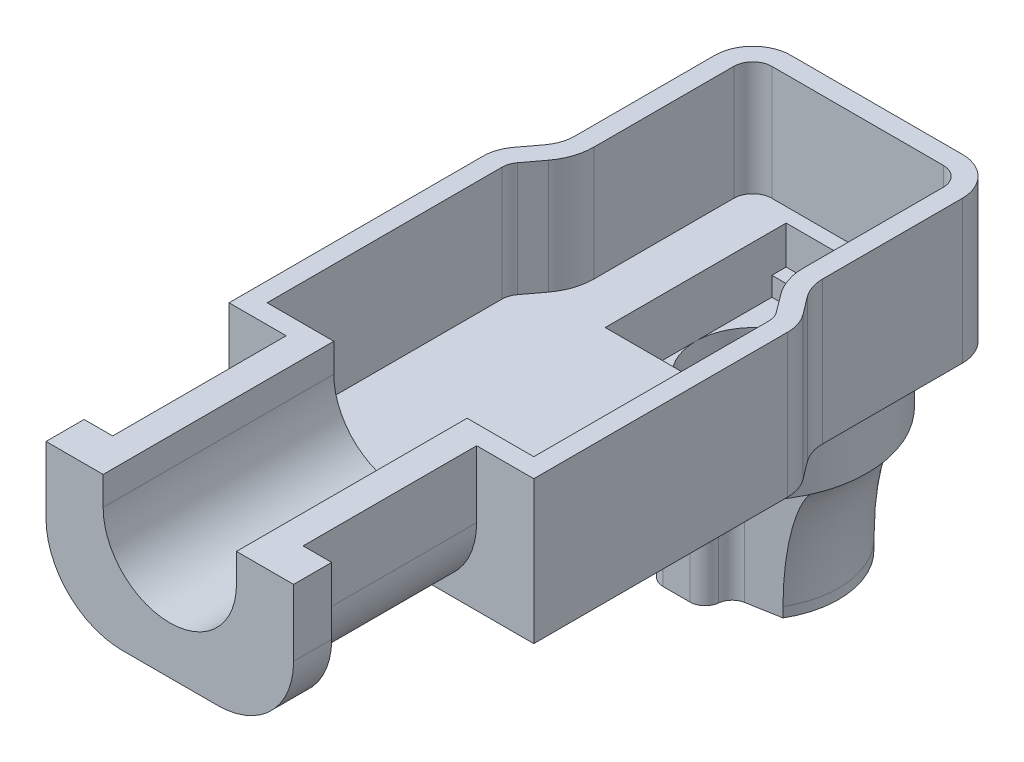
ISO-10303-21;
HEADER;
FILE_DESCRIPTION(('STEP AP214'),'2;1');
FILE_NAME('part.step','',(''),(''),'','','');
FILE_SCHEMA(('AUTOMOTIVE_DESIGN { 1 0 10303 214 1 1 1 1 }'));
ENDSEC;
DATA;
#1=APPLICATION_CONTEXT('core data for automotive mechanical design processes');
#2=APPLICATION_PROTOCOL_DEFINITION('international standard','automotive_design',2000,#1);
#3=PRODUCT_CONTEXT('',#1,'mechanical');
#4=PRODUCT('Part','Part','',(#3));
#5=PRODUCT_RELATED_PRODUCT_CATEGORY('part','',(#4));
#6=PRODUCT_DEFINITION_FORMATION('','',#4);
#7=PRODUCT_DEFINITION_CONTEXT('part definition',#1,'design');
#8=PRODUCT_DEFINITION('design','',#6,#7);
#9=PRODUCT_DEFINITION_SHAPE('','',#8);
#10=(LENGTH_UNIT() NAMED_UNIT(*) SI_UNIT(.MILLI.,.METRE.));
#11=(NAMED_UNIT(*) PLANE_ANGLE_UNIT() SI_UNIT($,.RADIAN.));
#12=(NAMED_UNIT(*) SI_UNIT($,.STERADIAN.) SOLID_ANGLE_UNIT());
#13=UNCERTAINTY_MEASURE_WITH_UNIT(LENGTH_MEASURE(1.E-05),#10,'distance_accuracy_value','');
#14=(GEOMETRIC_REPRESENTATION_CONTEXT(3) GLOBAL_UNCERTAINTY_ASSIGNED_CONTEXT((#13)) GLOBAL_UNIT_ASSIGNED_CONTEXT((#10,
#11,#12)) REPRESENTATION_CONTEXT('',''));
#15=CARTESIAN_POINT('',(0.,0.,0.));
#16=DIRECTION('',(0.,0.,1.));
#17=DIRECTION('',(1.,0.,0.));
#18=AXIS2_PLACEMENT_3D('',#15,#16,#17);
#19=CARTESIAN_POINT('',(-1.5,5.5,-0.605332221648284));
#20=DIRECTION('',(0.,0.,-1.));
#21=DIRECTION('',(-1.,0.,0.));
#22=AXIS2_PLACEMENT_3D('',#19,#20,#21);
#23=PLANE('',#22);
#24=DIRECTION('',(0.,-1.,0.));
#25=VECTOR('',#24,1.);
#26=CARTESIAN_POINT('',(-1.5,5.5,-0.605332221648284));
#27=LINE('',#26,#25);
#28=CARTESIAN_POINT('',(-1.5,4.5,-0.605332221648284));
#29=VERTEX_POINT('',#28);
#30=CARTESIAN_POINT('',(-1.5,4.,-0.605332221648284));
#31=VERTEX_POINT('',#30);
#32=EDGE_CURVE('E791',#29,#31,#27,.T.);
#33=ORIENTED_EDGE('',*,*,#32,.F.);
#34=DIRECTION('',(1.,0.,0.));
#35=VECTOR('',#34,1.);
#36=CARTESIAN_POINT('',(-1.5,4.5,-0.605332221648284));
#37=LINE('',#36,#35);
#38=CARTESIAN_POINT('',(1.5,4.5,-0.605332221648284));
#39=VERTEX_POINT('',#38);
#40=EDGE_CURVE('E764',#29,#39,#37,.T.);
#41=ORIENTED_EDGE('',*,*,#40,.T.);
#42=DIRECTION('',(0.,-1.,0.));
#43=VECTOR('',#42,1.);
#44=CARTESIAN_POINT('',(1.5,5.5,-0.605332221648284));
#45=LINE('',#44,#43);
#46=CARTESIAN_POINT('',(1.5,4.,-0.605332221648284));
#47=VERTEX_POINT('',#46);
#48=EDGE_CURVE('E789',#39,#47,#45,.T.);
#49=ORIENTED_EDGE('',*,*,#48,.T.);
#50=DIRECTION('',(1.,0.,0.));
#51=VECTOR('',#50,1.);
#52=CARTESIAN_POINT('',(-1.5,4.,-0.605332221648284));
#53=LINE('',#52,#51);
#54=EDGE_CURVE('E776',#31,#47,#53,.T.);
#55=ORIENTED_EDGE('',*,*,#54,.F.);
#56=EDGE_LOOP('',(#33,#41,#49,#55));
#57=FACE_BOUND('',#56,.T.);
#58=ADVANCED_FACE('F41',(#57),#23,.T.);
#59=CARTESIAN_POINT('',(-1.5,5.5,-4.60533222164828));
#60=DIRECTION('',(0.,0.,1.));
#61=DIRECTION('',(1.,0.,0.));
#62=AXIS2_PLACEMENT_3D('',#59,#60,#61);
#63=PLANE('',#62);
#64=DIRECTION('',(0.,-1.,0.));
#65=VECTOR('',#64,1.);
#66=CARTESIAN_POINT('',(1.5,5.5,-4.60533222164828));
#67=LINE('',#66,#65);
#68=CARTESIAN_POINT('',(1.5,4.5,-4.60533222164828));
#69=VERTEX_POINT('',#68);
#70=CARTESIAN_POINT('',(1.5,4.,-4.60533222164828));
#71=VERTEX_POINT('',#70);
#72=EDGE_CURVE('E787',#69,#71,#67,.T.);
#73=ORIENTED_EDGE('',*,*,#72,.F.);
#74=DIRECTION('',(-1.,0.,0.));
#75=VECTOR('',#74,1.);
#76=CARTESIAN_POINT('',(-1.5,4.5,-4.60533222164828));
#77=LINE('',#76,#75);
#78=CARTESIAN_POINT('',(-1.5,4.5,-4.60533222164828));
#79=VERTEX_POINT('',#78);
#80=EDGE_CURVE('E989',#69,#79,#77,.T.);
#81=ORIENTED_EDGE('',*,*,#80,.T.);
#82=DIRECTION('',(0.,-1.,0.));
#83=VECTOR('',#82,1.);
#84=CARTESIAN_POINT('',(-1.5,5.5,-4.60533222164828));
#85=LINE('',#84,#83);
#86=CARTESIAN_POINT('',(-1.5,4.,-4.60533222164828));
#87=VERTEX_POINT('',#86);
#88=EDGE_CURVE('E773',#79,#87,#85,.T.);
#89=ORIENTED_EDGE('',*,*,#88,.T.);
#90=DIRECTION('',(-1.,0.,0.));
#91=VECTOR('',#90,1.);
#92=CARTESIAN_POINT('',(-1.5,4.,-4.60533222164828));
#93=LINE('',#92,#91);
#94=EDGE_CURVE('E771',#71,#87,#93,.T.);
#95=ORIENTED_EDGE('',*,*,#94,.F.);
#96=EDGE_LOOP('',(#73,#81,#89,#95));
#97=FACE_BOUND('',#96,.T.);
#98=ADVANCED_FACE('F956',(#97),#63,.T.);
#99=CARTESIAN_POINT('',(0.,4.,-2.60533222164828));
#100=DIRECTION('',(0.,1.,0.));
#101=DIRECTION('',(0.,0.,1.));
#102=AXIS2_PLACEMENT_3D('',#99,#100,#101);
#103=PLANE('',#102);
#104=ORIENTED_EDGE('',*,*,#94,.T.);
#105=DIRECTION('',(0.,0.,1.));
#106=VECTOR('',#105,1.);
#107=CARTESIAN_POINT('',(-1.5,4.,-0.605332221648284));
#108=LINE('',#107,#106);
#109=CARTESIAN_POINT('',(-1.5,4.,-2.60533222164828));
#110=VERTEX_POINT('',#109);
#111=EDGE_CURVE('E767',#87,#110,#108,.T.);
#112=ORIENTED_EDGE('',*,*,#111,.T.);
#113=CARTESIAN_POINT('',(0.,4.,-2.60533222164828));
#114=DIRECTION('',(0.,1.,0.));
#115=DIRECTION('',(0.,0.,1.));
#116=AXIS2_PLACEMENT_3D('',#113,#114,#115);
#117=CIRCLE('',#116,1.50000000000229);
#118=CARTESIAN_POINT('',(1.5,4.,-2.60533222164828));
#119=VERTEX_POINT('',#118);
#120=EDGE_CURVE('E794',#119,#110,#117,.T.);
#121=ORIENTED_EDGE('',*,*,#120,.F.);
#122=DIRECTION('',(0.,0.,-1.));
#123=VECTOR('',#122,1.);
#124=CARTESIAN_POINT('',(1.5,4.,-0.605332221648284));
#125=LINE('',#124,#123);
#126=EDGE_CURVE('E783',#119,#71,#125,.T.);
#127=ORIENTED_EDGE('',*,*,#126,.T.);
#128=EDGE_LOOP('',(#104,#112,#121,#127));
#129=FACE_BOUND('',#128,.T.);
#130=ADVANCED_FACE('F962',(#129),#103,.T.);
#131=EDGE_CURVE('E793',#110,#119,#117,.T.);
#132=ORIENTED_EDGE('',*,*,#131,.F.);
#133=EDGE_CURVE('E777',#110,#31,#108,.T.);
#134=ORIENTED_EDGE('',*,*,#133,.T.);
#135=ORIENTED_EDGE('',*,*,#54,.T.);
#136=EDGE_CURVE('E780',#47,#119,#125,.T.);
#137=ORIENTED_EDGE('',*,*,#136,.T.);
#138=EDGE_LOOP('',(#132,#134,#135,#137));
#139=FACE_BOUND('',#138,.T.);
#140=ADVANCED_FACE('F948',(#139),#103,.T.);
#141=CARTESIAN_POINT('',(1.15,0.,-0.914720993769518));
#142=DIRECTION('',(0.,-1.,0.));
#143=DIRECTION('',(0.,0.,-1.));
#144=AXIS2_PLACEMENT_3D('',#141,#142,#143);
#145=PLANE('',#144);
#146=CARTESIAN_POINT('',(1.15,0.,-0.914720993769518));
#147=DIRECTION('',(0.,-1.,0.));
#148=DIRECTION('',(0.,0.,-1.));
#149=AXIS2_PLACEMENT_3D('',#146,#147,#148);
#150=CIRCLE('',#149,0.4);
#151=CARTESIAN_POINT('',(0.752279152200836,0.,-0.957360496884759));
#152=VERTEX_POINT('',#151);
#153=CARTESIAN_POINT('',(1.08012351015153,0.,-1.30857030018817));
#154=VERTEX_POINT('',#153);
#155=EDGE_CURVE('E817',#152,#154,#150,.T.);
#156=ORIENTED_EDGE('',*,*,#155,.F.);
#157=CARTESIAN_POINT('',(0.354558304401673,0.,-1.));
#158=DIRECTION('',(0.,-1.,0.));
#159=DIRECTION('',(0.,0.,-1.));
#160=AXIS2_PLACEMENT_3D('',#157,#158,#159);
#161=CIRCLE('',#160,0.4);
#162=CARTESIAN_POINT('',(0.354558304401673,0.,-0.6));
#163=VERTEX_POINT('',#162);
#164=EDGE_CURVE('E1077',#152,#163,#161,.T.);
#165=ORIENTED_EDGE('',*,*,#164,.T.);
#166=DIRECTION('',(1.,0.,0.));
#167=VECTOR('',#166,1.);
#168=CARTESIAN_POINT('',(-0.75,0.,-0.6));
#169=LINE('',#168,#167);
#170=CARTESIAN_POINT('',(-0.354558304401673,0.,-0.6));
#171=VERTEX_POINT('',#170);
#172=EDGE_CURVE('E801',#171,#163,#169,.T.);
#173=ORIENTED_EDGE('',*,*,#172,.F.);
#174=CARTESIAN_POINT('',(-0.354558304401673,0.,-1.));
#175=DIRECTION('',(0.,-1.,0.));
#176=DIRECTION('',(0.,0.,-1.));
#177=AXIS2_PLACEMENT_3D('',#174,#175,#176);
#178=CIRCLE('',#177,0.4);
#179=CARTESIAN_POINT('',(-0.752279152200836,0.,-0.957360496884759));
#180=VERTEX_POINT('',#179);
#181=EDGE_CURVE('E1075',#171,#180,#178,.T.);
#182=ORIENTED_EDGE('',*,*,#181,.T.);
#183=CARTESIAN_POINT('',(-1.15,0.,-0.914720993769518));
#184=DIRECTION('',(0.,-1.,0.));
#185=DIRECTION('',(0.,0.,-1.));
#186=AXIS2_PLACEMENT_3D('',#183,#184,#185);
#187=CIRCLE('',#186,0.4);
#188=CARTESIAN_POINT('',(-1.08012351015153,0.,-1.30857030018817));
#189=VERTEX_POINT('',#188);
#190=EDGE_CURVE('E807',#189,#180,#187,.T.);
#191=ORIENTED_EDGE('',*,*,#190,.F.);
#192=DIRECTION('',(0.98462326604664,0.,0.174691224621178));
#193=VECTOR('',#192,1.);
#194=CARTESIAN_POINT('',(-1.93703222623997,0.,-1.46060249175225));
#195=LINE('',#194,#193);
#196=CARTESIAN_POINT('',(-1.93703222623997,0.,-1.46060249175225));
#197=VERTEX_POINT('',#196);
#198=EDGE_CURVE('E825',#197,#189,#195,.T.);
#199=ORIENTED_EDGE('',*,*,#198,.F.);
#200=CARTESIAN_POINT('',(0.,0.,-2.60533222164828));
#201=DIRECTION('',(0.,1.,0.));
#202=DIRECTION('',(0.,0.,-1.));
#203=AXIS2_PLACEMENT_3D('',#200,#201,#202);
#204=CIRCLE('',#203,2.25);
#205=CARTESIAN_POINT('',(1.93703222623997,0.,-1.46060249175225));
#206=VERTEX_POINT('',#205);
#207=EDGE_CURVE('E822',#206,#197,#204,.T.);
#208=ORIENTED_EDGE('',*,*,#207,.F.);
#209=DIRECTION('',(0.98462326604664,0.,-0.174691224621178));
#210=VECTOR('',#209,1.);
#211=CARTESIAN_POINT('',(1.08012351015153,0.,-1.30857030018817));
#212=LINE('',#211,#210);
#213=EDGE_CURVE('E819',#154,#206,#212,.T.);
#214=ORIENTED_EDGE('',*,*,#213,.F.);
#215=EDGE_LOOP('',(#156,#165,#173,#182,#191,#199,#208,#214));
#216=FACE_BOUND('',#215,.T.);
#217=CARTESIAN_POINT('',(0.,0.,-2.60533222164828));
#218=DIRECTION('',(0.,1.,0.));
#219=DIRECTION('',(0.,0.,1.));
#220=AXIS2_PLACEMENT_3D('',#217,#218,#219);
#221=CIRCLE('',#220,1.50000000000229);
#222=CARTESIAN_POINT('',(0.,0.,-1.10533222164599));
#223=VERTEX_POINT('',#222);
#224=EDGE_CURVE('E798',#223,#223,#221,.T.);
#225=ORIENTED_EDGE('',*,*,#224,.T.);
#226=EDGE_LOOP('',(#225));
#227=FACE_BOUND('',#226,.T.);
#228=ADVANCED_FACE('F945',(#216,#227),#145,.T.);
#229=CARTESIAN_POINT('',(-0.75,3.25,-0.6));
#230=DIRECTION('',(0.,0.,-1.));
#231=DIRECTION('',(-1.,0.,0.));
#232=AXIS2_PLACEMENT_3D('',#229,#230,#231);
#233=PLANE('',#232);
#234=ORIENTED_EDGE('',*,*,#172,.T.);
#235=DIRECTION('',(0.,-1.,0.));
#236=VECTOR('',#235,1.);
#237=CARTESIAN_POINT('',(0.354558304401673,3.25,-0.6));
#238=LINE('',#237,#236);
#239=CARTESIAN_POINT('',(0.354558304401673,3.25,-0.6));
#240=VERTEX_POINT('',#239);
#241=EDGE_CURVE('E1082',#163,#240,#238,.F.);
#242=ORIENTED_EDGE('',*,*,#241,.T.);
#243=DIRECTION('',(1.,0.,0.));
#244=VECTOR('',#243,1.);
#245=CARTESIAN_POINT('',(-0.75,3.25,-0.6));
#246=LINE('',#245,#244);
#247=CARTESIAN_POINT('',(-0.354558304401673,3.25,-0.6));
#248=VERTEX_POINT('',#247);
#249=EDGE_CURVE('E803',#248,#240,#246,.T.);
#250=ORIENTED_EDGE('',*,*,#249,.F.);
#251=DIRECTION('',(0.,-1.,0.));
#252=VECTOR('',#251,1.);
#253=CARTESIAN_POINT('',(-0.354558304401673,3.25,-0.6));
#254=LINE('',#253,#252);
#255=EDGE_CURVE('E1079',#248,#171,#254,.T.);
#256=ORIENTED_EDGE('',*,*,#255,.T.);
#257=EDGE_LOOP('',(#234,#242,#250,#256));
#258=FACE_BOUND('',#257,.T.);
#259=ADVANCED_FACE('F947',(#258),#233,.F.);
#260=CARTESIAN_POINT('',(1.15,3.25,-0.914720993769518));
#261=DIRECTION('',(0.,-1.,0.));
#262=DIRECTION('',(0.,0.,-1.));
#263=AXIS2_PLACEMENT_3D('',#260,#261,#262);
#264=CYLINDRICAL_SURFACE('',#263,0.4);
#265=CARTESIAN_POINT('',(1.15,3.25,-0.914720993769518));
#266=DIRECTION('',(0.,-1.,0.));
#267=DIRECTION('',(0.,0.,-1.));
#268=AXIS2_PLACEMENT_3D('',#265,#266,#267);
#269=CIRCLE('',#268,0.4);
#270=CARTESIAN_POINT('',(0.752279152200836,3.25,-0.957360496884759));
#271=VERTEX_POINT('',#270);
#272=CARTESIAN_POINT('',(1.08012351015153,3.25,-1.30857030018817));
#273=VERTEX_POINT('',#272);
#274=EDGE_CURVE('E806',#271,#273,#269,.T.);
#275=ORIENTED_EDGE('',*,*,#274,.F.);
#276=DIRECTION('',(0.,-1.,0.));
#277=VECTOR('',#276,1.);
#278=CARTESIAN_POINT('',(0.752279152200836,3.25,-0.957360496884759));
#279=LINE('',#278,#277);
#280=EDGE_CURVE('E1072',#271,#152,#279,.T.);
#281=ORIENTED_EDGE('',*,*,#280,.T.);
#282=ORIENTED_EDGE('',*,*,#155,.T.);
#283=DIRECTION('',(0.,-1.,0.));
#284=VECTOR('',#283,1.);
#285=CARTESIAN_POINT('',(1.08012351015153,3.25,-1.30857030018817));
#286=LINE('',#285,#284);
#287=EDGE_CURVE('E841',#273,#154,#286,.T.);
#288=ORIENTED_EDGE('',*,*,#287,.F.);
#289=EDGE_LOOP('',(#275,#281,#282,#288));
#290=FACE_BOUND('',#289,.T.);
#291=ADVANCED_FACE('F864',(#290),#264,.F.);
#292=CARTESIAN_POINT('',(1.08012351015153,3.25,-1.30857030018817));
#293=DIRECTION('',(-0.174691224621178,0.,-0.98462326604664));
#294=DIRECTION('',(-0.98462326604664,0.,0.174691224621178));
#295=AXIS2_PLACEMENT_3D('',#292,#293,#294);
#296=PLANE('',#295);
#297=ORIENTED_EDGE('',*,*,#213,.T.);
#298=DIRECTION('',(0.,-1.,0.));
#299=VECTOR('',#298,1.);
#300=CARTESIAN_POINT('',(1.93703222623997,3.25,-1.46060249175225));
#301=LINE('',#300,#299);
#302=CARTESIAN_POINT('',(1.93669179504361,0.260434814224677,-1.46054209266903));
#303=VERTEX_POINT('',#302);
#304=EDGE_CURVE('E839',#303,#206,#301,.T.);
#305=ORIENTED_EDGE('',*,*,#304,.F.);
#306=CARTESIAN_POINT('',(2.83289281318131,3.25000000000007,-1.61975571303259));
#307=CARTESIAN_POINT('',(2.82994253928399,3.24978154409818,-1.6192324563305));
#308=CARTESIAN_POINT('',(2.82699595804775,3.24951415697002,-1.61870902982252));
#309=CARTESIAN_POINT('',(2.82107210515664,3.24887857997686,-1.61765532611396));
#310=CARTESIAN_POINT('',(2.81809497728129,3.24850903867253,-1.61712505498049));
#311=CARTESIAN_POINT('',(2.81211021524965,3.247666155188,-1.61605790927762));
#312=CARTESIAN_POINT('',(2.80910278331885,3.24719135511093,-1.61552105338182));
#313=CARTESIAN_POINT('',(2.80305757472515,3.2461350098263,-1.61444096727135));
#314=CARTESIAN_POINT('',(2.80002006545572,3.24555190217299,-1.6138977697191));
#315=CARTESIAN_POINT('',(2.79391488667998,3.24427593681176,-1.61280522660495));
#316=CARTESIAN_POINT('',(2.79084755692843,3.24358141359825,-1.61225592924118));
#317=CARTESIAN_POINT('',(2.78468293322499,3.24207958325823,-1.61115140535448));
#318=CARTESIAN_POINT('',(2.78158605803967,3.24127051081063,-1.6105962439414));
#319=CARTESIAN_POINT('',(2.77536255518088,3.23953651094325,-1.6094802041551));
#320=CARTESIAN_POINT('',(2.77223643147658,3.23860972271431,-1.60891940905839));
#321=CARTESIAN_POINT('',(2.7659546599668,3.2366371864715,-1.60779230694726));
#322=CARTESIAN_POINT('',(2.76279960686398,3.23558948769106,-1.60722610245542));
#323=CARTESIAN_POINT('',(2.75646022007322,3.2333719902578,-1.60608837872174));
#324=CARTESIAN_POINT('',(2.75327657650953,3.2322001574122,-1.60551698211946));
#325=CARTESIAN_POINT('',(2.7468802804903,3.22973122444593,-1.60436906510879));
#326=CARTESIAN_POINT('',(2.74366841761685,3.22843201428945,-1.60379268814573));
#327=CARTESIAN_POINT('',(2.73721593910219,3.22570510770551,-1.6026349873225));
#328=CARTESIAN_POINT('',(2.73397621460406,3.22427523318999,-1.60205382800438));
#329=CARTESIAN_POINT('',(2.72746842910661,3.2212838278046,-1.60088675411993));
#330=CARTESIAN_POINT('',(2.72420136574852,3.21972006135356,-1.60030102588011));
#331=CARTESIAN_POINT('',(2.71424173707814,3.21476845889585,-1.59851609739));
#332=CARTESIAN_POINT('',(2.70762585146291,3.21121986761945,-1.59733135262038));
#333=CARTESIAN_POINT('',(2.6942805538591,3.20356571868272,-1.59494389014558));
#334=CARTESIAN_POINT('',(2.68756166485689,3.19944131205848,-1.59374317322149));
#335=CARTESIAN_POINT('',(2.67401231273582,3.19060882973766,-1.59132454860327));
#336=CARTESIAN_POINT('',(2.66719393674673,3.18588163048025,-1.59010894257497));
#337=CARTESIAN_POINT('',(2.65344890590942,3.17581688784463,-1.58766132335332));
#338=CARTESIAN_POINT('',(2.64653582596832,3.17046024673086,-1.58643188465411));
#339=CARTESIAN_POINT('',(2.63260502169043,3.15910963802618,-1.58395717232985));
#340=CARTESIAN_POINT('',(2.6256021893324,3.15309684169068,-1.58271469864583));
#341=CARTESIAN_POINT('',(2.61149620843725,3.14040692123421,-1.58021435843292));
#342=CARTESIAN_POINT('',(2.6044090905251,3.1337114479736,-1.57895946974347));
#343=CARTESIAN_POINT('',(2.59013947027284,3.1196293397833,-1.57643443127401));
#344=CARTESIAN_POINT('',(2.5829739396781,3.11222500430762,-1.57516737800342));
#345=CARTESIAN_POINT('',(2.56855318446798,3.09669851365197,-1.57261842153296));
#346=CARTESIAN_POINT('',(2.56131568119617,3.08855942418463,-1.57133970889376));
#347=CARTESIAN_POINT('',(2.54675694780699,3.07153792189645,-1.56876565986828));
#348=CARTESIAN_POINT('',(2.53945397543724,3.06263946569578,-1.5674734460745));
#349=CARTESIAN_POINT('',(2.52477246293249,3.0440719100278,-1.56487831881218));
#350=CARTESIAN_POINT('',(2.5174126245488,3.0343875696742,-1.56357886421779));
#351=CARTESIAN_POINT('',(2.50578177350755,3.01854028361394,-1.56150618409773));
#352=CARTESIAN_POINT('',(2.50140949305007,3.0124525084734,-1.56072242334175));
#353=CARTESIAN_POINT('',(2.49150205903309,2.99837225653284,-1.55893941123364));
#354=CARTESIAN_POINT('',(2.48600701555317,2.99035085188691,-1.55794526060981));
#355=CARTESIAN_POINT('',(2.47386422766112,2.97216915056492,-1.55575274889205));
#356=CARTESIAN_POINT('',(2.4672691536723,2.9619724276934,-1.55456499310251));
#357=CARTESIAN_POINT('',(2.45294259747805,2.93915868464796,-1.55199336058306));
#358=CARTESIAN_POINT('',(2.44527696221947,2.92649881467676,-1.55062320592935));
#359=CARTESIAN_POINT('',(2.42883544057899,2.8984309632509,-1.54769679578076));
#360=CARTESIAN_POINT('',(2.42013961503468,2.88297442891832,-1.54615729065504));
#361=CARTESIAN_POINT('',(2.40167542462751,2.84894392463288,-1.54289932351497));
#362=CARTESIAN_POINT('',(2.39200182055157,2.83031687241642,-1.54119963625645));
#363=CARTESIAN_POINT('',(2.371635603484,2.78953993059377,-1.53762792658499));
#364=CARTESIAN_POINT('',(2.36105268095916,2.76733364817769,-1.53577632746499));
#365=CARTESIAN_POINT('',(2.3389346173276,2.71897001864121,-1.53188939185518));
#366=CARTESIAN_POINT('',(2.32752268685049,2.6927550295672,-1.52987283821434));
#367=CARTESIAN_POINT('',(2.30238952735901,2.63239839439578,-1.52543709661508));
#368=CARTESIAN_POINT('',(2.28894394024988,2.59813845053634,-1.52306817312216));
#369=CARTESIAN_POINT('',(2.26328164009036,2.52920847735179,-1.518574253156));
#370=CARTESIAN_POINT('',(2.25106309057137,2.49453915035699,-1.51644889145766));
#371=CARTESIAN_POINT('',(2.22781980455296,2.4252931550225,-1.51239616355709));
#372=CARTESIAN_POINT('',(2.21678166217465,2.39072109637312,-1.51046659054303));
#373=CARTESIAN_POINT('',(2.19585975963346,2.32212202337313,-1.50679130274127));
#374=CARTESIAN_POINT('',(2.18595477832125,2.28810161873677,-1.5050423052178));
#375=CARTESIAN_POINT('',(2.15845785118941,2.18951136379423,-1.50015000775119));
#376=CARTESIAN_POINT('',(2.14185594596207,2.12465693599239,-1.49714868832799));
#377=CARTESIAN_POINT('',(2.11266573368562,2.00128360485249,-1.4918412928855));
#378=CARTESIAN_POINT('',(2.09983850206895,1.94282217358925,-1.48949524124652));
#379=CARTESIAN_POINT('',(2.07443319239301,1.8179854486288,-1.48497131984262));
#380=CARTESIAN_POINT('',(2.06209884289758,1.75155836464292,-1.48285377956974));
#381=CARTESIAN_POINT('',(2.03920835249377,1.617136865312,-1.47896204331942));
#382=CARTESIAN_POINT('',(2.02868899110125,1.54913605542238,-1.47719486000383));
#383=CARTESIAN_POINT('',(2.00942635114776,1.41223336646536,-1.4739554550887));
#384=CARTESIAN_POINT('',(2.00070047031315,1.3433289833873,-1.47248612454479));
#385=CARTESIAN_POINT('',(1.9849929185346,1.20524964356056,-1.46980211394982));
#386=CARTESIAN_POINT('',(1.97801296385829,1.13607448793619,-1.46858768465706));
#387=CARTESIAN_POINT('',(1.96574911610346,0.998030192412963,-1.46639865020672));
#388=CARTESIAN_POINT('',(1.96045435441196,0.929162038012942,-1.46542251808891));
#389=CARTESIAN_POINT('',(1.95149903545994,0.792246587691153,-1.46371469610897));
#390=CARTESIAN_POINT('',(1.9478174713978,0.724200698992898,-1.46297989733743));
#391=CARTESIAN_POINT('',(1.94201521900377,0.589377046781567,-1.46177544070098));
#392=CARTESIAN_POINT('',(1.93986533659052,0.522600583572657,-1.4613008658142));
#393=CARTESIAN_POINT('',(1.93705363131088,0.390693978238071,-1.46066006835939));
#394=CARTESIAN_POINT('',(1.93635576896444,0.32556463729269,-1.46048639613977));
#395=CARTESIAN_POINT('',(1.93635136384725,0.260434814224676,-1.4604816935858));
#396=B_SPLINE_CURVE_WITH_KNOTS('',3,(#306,#307,#308,#309,#310,#311,#312,#313,#314,#315,#316,
#317,#318,#319,#320,#321,#322,#323,#324,#325,#326,#327,#328,#329,#330,#331,#332,#333,#334,#335,
#336,#337,#338,#339,#340,#341,#342,#343,#344,#345,#346,#347,#348,#349,#350,#351,#352,#353,#354,
#355,#356,#357,#358,#359,#360,#361,#362,#363,#364,#365,#366,#367,#368,#369,#370,#371,#372,#373,
#374,#375,#376,#377,#378,#379,#380,#381,#382,#383,#384,#385,#386,#387,#388,#389,#390,#391,#392,
#393,#394,#395),.UNSPECIFIED.,.F.,.F.,(4,2,2,2,2,2,2,2,2,2,2,2,2,2,2,2,2,2,2,2,2,2,2,2,2,2,2,2,
2,2,2,2,2,2,2,2,2,2,2,2,2,2,2,2,4),(0.,0.00901235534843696,0.0181501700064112,
0.0274234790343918,0.0368427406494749,0.0464188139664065,0.0561629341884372,0.066086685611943,
0.0762019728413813,0.0865209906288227,0.0970561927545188,0.107820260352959,0.118826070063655,
0.141612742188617,0.165524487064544,0.190668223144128,0.217151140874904,0.245079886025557,
0.274559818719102,0.305694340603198,0.33858427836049,0.373327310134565,0.410017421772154,
0.432624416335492,0.461942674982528,0.498542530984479,0.543124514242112,0.596519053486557,
0.659680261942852,0.733671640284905,0.819641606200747,0.930252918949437,1.04069613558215,
1.14970973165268,1.25612892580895,1.45710798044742,1.63677422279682,1.83952280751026,
2.04599147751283,2.25437719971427,2.46296696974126,2.67018282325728,2.87461376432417,
3.07503566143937,3.27042063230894),.UNSPECIFIED.);
#397=CARTESIAN_POINT('',(2.83334330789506,3.25,-1.61934758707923));
#398=VERTEX_POINT('',#397);
#399=EDGE_CURVE('E14',#303,#398,#396,.F.);
#400=ORIENTED_EDGE('',*,*,#399,.T.);
#401=DIRECTION('',(0.98462326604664,0.,-0.174691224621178));
#402=VECTOR('',#401,1.);
#403=CARTESIAN_POINT('',(1.08012351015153,3.25,-1.30857030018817));
#404=LINE('',#403,#402);
#405=EDGE_CURVE('E809',#273,#398,#404,.T.);
#406=ORIENTED_EDGE('',*,*,#405,.F.);
#407=ORIENTED_EDGE('',*,*,#287,.T.);
#408=EDGE_LOOP('',(#297,#305,#400,#406,#407));
#409=FACE_BOUND('',#408,.T.);
#410=ADVANCED_FACE('F858',(#409),#296,.F.);
#411=CARTESIAN_POINT('',(0.,3.25,-2.60533222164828));
#412=DIRECTION('',(0.,-1.,0.));
#413=DIRECTION('',(0.,0.,-1.));
#414=AXIS2_PLACEMENT_3D('',#411,#412,#413);
#415=CYLINDRICAL_SURFACE('',#414,2.25);
#416=DIRECTION('',(0.,-1.,0.));
#417=VECTOR('',#416,1.);
#418=CARTESIAN_POINT('',(-1.93703222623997,3.25,-1.46060249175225));
#419=LINE('',#418,#417);
#420=CARTESIAN_POINT('',(-1.93680607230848,0.260434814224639,-1.46073584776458));
#421=VERTEX_POINT('',#420);
#422=EDGE_CURVE('E831',#421,#197,#419,.T.);
#423=ORIENTED_EDGE('',*,*,#422,.F.);
#424=CARTESIAN_POINT('',(1.65515379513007,0.26043481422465,-1.08120430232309));
#425=CARTESIAN_POINT('',(1.94943166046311,0.260434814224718,-1.40078057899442));
#426=CARTESIAN_POINT('',(2.14777999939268,0.260434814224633,-1.80661312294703));
#427=CARTESIAN_POINT('',(2.29076382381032,0.260434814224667,-2.66288418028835));
#428=CARTESIAN_POINT('',(2.23488867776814,0.26043481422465,-3.11147817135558));
#429=CARTESIAN_POINT('',(1.88622471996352,0.26043481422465,-3.90651146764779));
#430=CARTESIAN_POINT('',(1.59407753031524,0.260434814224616,-4.25148772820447));
#431=CARTESIAN_POINT('',(0.867328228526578,0.260434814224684,-4.72633501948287));
#432=CARTESIAN_POINT('',(0.434063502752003,0.26043481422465,-4.85533222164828));
#433=CARTESIAN_POINT('',(-0.434063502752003,0.26043481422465,-4.85533222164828));
#434=CARTESIAN_POINT('',(-0.867328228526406,0.260434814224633,-4.72633501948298));
#435=CARTESIAN_POINT('',(-1.59407753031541,0.260434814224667,-4.25148772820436));
#436=CARTESIAN_POINT('',(-1.8862247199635,0.26043481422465,-3.90651146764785));
#437=CARTESIAN_POINT('',(-2.23488867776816,0.26043481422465,-3.11147817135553));
#438=CARTESIAN_POINT('',(-2.29076382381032,0.260434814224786,-2.66288418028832));
#439=CARTESIAN_POINT('',(-2.14777999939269,0.260434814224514,-1.80661312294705));
#440=CARTESIAN_POINT('',(-1.94943166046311,0.260434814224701,-1.40078057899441));
#441=CARTESIAN_POINT('',(-1.65515379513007,0.26043481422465,-1.08120430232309));
#442=(BOUNDED_CURVE() B_SPLINE_CURVE(3,(#424,#425,#426,#427,#428,#429,#430,#431,#432,#433,#434,
#435,#436,#437,#438,#439,#440,#441),.UNSPECIFIED.,.F.,.F.) B_SPLINE_CURVE_WITH_KNOTS((4,2,2,2,2,
2,2,2,4),(0.826587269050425,1.40533861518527,1.98408996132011,2.56284130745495,3.14159265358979,
3.72034399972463,4.29909534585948,4.87784669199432,5.45659803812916),
.UNSPECIFIED.) CURVE() GEOMETRIC_REPRESENTATION_ITEM() RATIONAL_B_SPLINE_CURVE((1.,1.,1.,1.,1.,
1.,1.,1.,1.,1.,1.,1.,1.,1.,1.,1.,1.,1.)) REPRESENTATION_ITEM(''));
#443=EDGE_CURVE('E61',#421,#303,#442,.F.);
#444=ORIENTED_EDGE('',*,*,#443,.T.);
#445=ORIENTED_EDGE('',*,*,#304,.T.);
#446=ORIENTED_EDGE('',*,*,#207,.T.);
#447=EDGE_LOOP('',(#423,#444,#445,#446));
#448=FACE_BOUND('',#447,.T.);
#449=ADVANCED_FACE('F847',(#448),#415,.T.);
#450=CARTESIAN_POINT('',(-1.93703222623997,3.25,-1.46060249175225));
#451=DIRECTION('',(0.174691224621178,0.,-0.98462326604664));
#452=DIRECTION('',(-0.98462326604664,0.,-0.174691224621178));
#453=AXIS2_PLACEMENT_3D('',#450,#451,#452);
#454=PLANE('',#453);
#455=ORIENTED_EDGE('',*,*,#198,.T.);
#456=DIRECTION('',(0.,-1.,0.));
#457=VECTOR('',#456,1.);
#458=CARTESIAN_POINT('',(-1.08012351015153,3.25,-1.30857030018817));
#459=LINE('',#458,#457);
#460=CARTESIAN_POINT('',(-1.08012351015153,3.25,-1.30857030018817));
#461=VERTEX_POINT('',#460);
#462=EDGE_CURVE('E813',#461,#189,#459,.T.);
#463=ORIENTED_EDGE('',*,*,#462,.F.);
#464=DIRECTION('',(0.98462326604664,0.,0.174691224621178));
#465=VECTOR('',#464,1.);
#466=CARTESIAN_POINT('',(-1.93703222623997,3.25,-1.46060249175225));
#467=LINE('',#466,#465);
#468=CARTESIAN_POINT('',(-2.83331859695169,3.25001739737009,-1.61947960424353));
#469=VERTEX_POINT('',#468);
#470=EDGE_CURVE('E814',#469,#461,#467,.T.);
#471=ORIENTED_EDGE('',*,*,#470,.F.);
#472=CARTESIAN_POINT('',(-1.93635136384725,0.260434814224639,-1.4604816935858));
#473=CARTESIAN_POINT('',(-1.93635572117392,0.325416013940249,-1.46048634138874));
#474=CARTESIAN_POINT('',(-1.93705019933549,0.390396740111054,-1.46065886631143));
#475=CARTESIAN_POINT('',(-1.93984821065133,0.521991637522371,-1.46129565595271));
#476=CARTESIAN_POINT('',(-1.94198737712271,0.588605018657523,-1.46176727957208));
#477=CARTESIAN_POINT('',(-1.94776035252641,0.723090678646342,-1.46296453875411));
#478=CARTESIAN_POINT('',(-1.95142301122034,0.79096167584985,-1.46369503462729));
#479=CARTESIAN_POINT('',(-1.96033168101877,0.927519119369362,-1.46539316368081));
#480=CARTESIAN_POINT('',(-1.96559843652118,0.996204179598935,-1.466363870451));
#481=CARTESIAN_POINT('',(-1.97779649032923,1.13387865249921,-1.46854100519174));
#482=CARTESIAN_POINT('',(-1.9847385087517,1.20286709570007,-1.46974894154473));
#483=CARTESIAN_POINT('',(-2.00035955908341,1.34057489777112,-1.4724187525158));
#484=CARTESIAN_POINT('',(-2.00903688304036,1.40929445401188,-1.47388037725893));
#485=CARTESIAN_POINT('',(-2.02819099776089,1.54583576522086,-1.47710256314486));
#486=CARTESIAN_POINT('',(-2.03865061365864,1.6136599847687,-1.47886026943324));
#487=CARTESIAN_POINT('',(-2.06140987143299,1.74774347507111,-1.48273084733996));
#488=CARTESIAN_POINT('',(-2.07367324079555,1.81400903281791,-1.48483680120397));
#489=CARTESIAN_POINT('',(-2.09898152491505,1.93880999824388,-1.48934295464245));
#490=CARTESIAN_POINT('',(-2.1117925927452,1.99739491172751,-1.49168541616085));
#491=CARTESIAN_POINT('',(-2.14092672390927,2.12092705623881,-1.49698135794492));
#492=CARTESIAN_POINT('',(-2.15748524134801,2.18581782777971,-1.49997425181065));
#493=CARTESIAN_POINT('',(-2.18490324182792,2.28443989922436,-1.50485226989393));
#494=CARTESIAN_POINT('',(-2.19477444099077,2.31845438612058,-1.5065953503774));
#495=CARTESIAN_POINT('',(-2.21562033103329,2.38703145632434,-1.51025757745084));
#496=CARTESIAN_POINT('',(-2.226615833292,2.4215875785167,-1.51217994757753));
#497=CARTESIAN_POINT('',(-2.24976473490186,2.49079722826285,-1.51621678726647));
#498=CARTESIAN_POINT('',(-2.26193123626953,2.52544626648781,-1.5183334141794));
#499=CARTESIAN_POINT('',(-2.28747980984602,2.59433762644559,-1.52280807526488));
#500=CARTESIAN_POINT('',(-2.30086360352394,2.62857929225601,-1.52516645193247));
#501=CARTESIAN_POINT('',(-2.32602815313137,2.68927600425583,-1.52960747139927));
#502=CARTESIAN_POINT('',(-2.33754721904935,2.71584283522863,-1.53164257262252));
#503=CARTESIAN_POINT('',(-2.35985499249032,2.76479330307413,-1.53556167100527));
#504=CARTESIAN_POINT('',(-2.37051604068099,2.78723644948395,-1.53742624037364));
#505=CARTESIAN_POINT('',(-2.39100980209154,2.8283884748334,-1.54101926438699));
#506=CARTESIAN_POINT('',(-2.40072920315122,2.84715543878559,-1.54272659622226));
#507=CARTESIAN_POINT('',(-2.41925291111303,2.88138340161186,-1.54599479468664));
#508=CARTESIAN_POINT('',(-2.42795970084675,2.8968988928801,-1.54753627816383));
#509=CARTESIAN_POINT('',(-2.44438857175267,2.9250159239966,-1.55046106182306));
#510=CARTESIAN_POINT('',(-2.45202864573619,2.93766708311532,-1.55182711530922));
#511=CARTESIAN_POINT('',(-2.4662676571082,2.96040529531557,-1.55438430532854));
#512=CARTESIAN_POINT('',(-2.47279954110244,2.97053587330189,-1.55556138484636));
#513=CARTESIAN_POINT('',(-2.48477828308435,2.98853448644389,-1.55772592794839));
#514=CARTESIAN_POINT('',(-2.49017190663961,2.99643922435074,-1.5587025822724));
#515=CARTESIAN_POINT('',(-2.49983788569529,3.01023942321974,-1.56044327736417));
#516=CARTESIAN_POINT('',(-2.50407018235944,3.01616363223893,-1.56120235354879));
#517=CARTESIAN_POINT('',(-2.51560133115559,3.03197153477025,-1.56325800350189));
#518=CARTESIAN_POINT('',(-2.52300735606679,3.04177625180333,-1.56456520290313));
#519=CARTESIAN_POINT('',(-2.53778128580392,3.06057284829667,-1.56717619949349));
#520=CARTESIAN_POINT('',(-2.54513012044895,3.06958017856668,-1.56847645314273));
#521=CARTESIAN_POINT('',(-2.55978031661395,3.08680835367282,-1.57106636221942));
#522=CARTESIAN_POINT('',(-2.56706305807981,3.09504546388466,-1.57235284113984));
#523=CARTESIAN_POINT('',(-2.58157390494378,3.11075733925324,-1.57491728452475));
#524=CARTESIAN_POINT('',(-2.58878392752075,3.11824928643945,-1.5761919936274));
#525=CARTESIAN_POINT('',(-2.60314199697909,3.13249646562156,-1.57873227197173));
#526=CARTESIAN_POINT('',(-2.61027271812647,3.13926966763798,-1.57999468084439));
#527=CARTESIAN_POINT('',(-2.62446521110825,3.15210538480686,-1.58250999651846));
#528=CARTESIAN_POINT('',(-2.63151061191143,3.15818654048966,-1.58375986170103));
#529=CARTESIAN_POINT('',(-2.64552579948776,3.16966476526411,-1.58624929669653));
#530=CARTESIAN_POINT('',(-2.65248036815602,3.17508097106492,-1.58748600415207));
#531=CARTESIAN_POINT('',(-2.66630724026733,3.18525613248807,-1.58994803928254));
#532=CARTESIAN_POINT('',(-2.67316567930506,3.19003451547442,-1.59117073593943));
#533=CARTESIAN_POINT('',(-2.68679478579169,3.19896165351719,-1.5936035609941));
#534=CARTESIAN_POINT('',(-2.69355306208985,3.20312984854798,-1.59481132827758));
#535=CARTESIAN_POINT('',(-2.7037391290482,3.20899908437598,-1.596633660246));
#536=CARTESIAN_POINT('',(-2.70707864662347,3.21085965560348,-1.59723142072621));
#537=CARTESIAN_POINT('',(-2.71373210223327,3.21443617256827,-1.59842291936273));
#538=CARTESIAN_POINT('',(-2.71704480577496,3.21615448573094,-1.59901642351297));
#539=CARTESIAN_POINT('',(-2.72364394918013,3.21944985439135,-1.6001991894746));
#540=CARTESIAN_POINT('',(-2.72692926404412,3.22102923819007,-1.60078823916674));
#541=CARTESIAN_POINT('',(-2.73347310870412,3.22405019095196,-1.60196188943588));
#542=CARTESIAN_POINT('',(-2.73673062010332,3.22549403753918,-1.60254629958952));
#543=CARTESIAN_POINT('',(-2.74321832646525,3.22824732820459,-1.60371044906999));
#544=CARTESIAN_POINT('',(-2.74644760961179,3.22955899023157,-1.60429001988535));
#545=CARTESIAN_POINT('',(-2.75287836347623,3.23205131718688,-1.60544426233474));
#546=CARTESIAN_POINT('',(-2.75607902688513,3.23323413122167,-1.60601878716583));
#547=CARTESIAN_POINT('',(-2.7624520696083,3.23547215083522,-1.60716270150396));
#548=CARTESIAN_POINT('',(-2.76562374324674,3.23652942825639,-1.60773196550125));
#549=CARTESIAN_POINT('',(-2.77193836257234,3.23851974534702,-1.60886511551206));
#550=CARTESIAN_POINT('',(-2.77508070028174,3.23945477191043,-1.60942889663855));
#551=CARTESIAN_POINT('',(-2.78133623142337,3.24120393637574,-1.61055083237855));
#552=CARTESIAN_POINT('',(-2.78444890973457,3.24201996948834,-1.61110890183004));
#553=CARTESIAN_POINT('',(-2.79064473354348,3.24353447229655,-1.61221916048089));
#554=CARTESIAN_POINT('',(-2.79372745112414,3.2442347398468,-1.61277128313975));
#555=CARTESIAN_POINT('',(-2.79986299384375,3.24552100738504,-1.61386939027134));
#556=CARTESIAN_POINT('',(-2.80291547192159,3.24610870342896,-1.61441532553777));
#557=CARTESIAN_POINT('',(-2.80899020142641,3.24717310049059,-1.61550079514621));
#558=CARTESIAN_POINT('',(-2.81201217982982,3.24765139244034,-1.61604029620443));
#559=CARTESIAN_POINT('',(-2.81802561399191,3.2485001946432,-1.61711263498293));
#560=CARTESIAN_POINT('',(-2.82101686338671,3.2488721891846,-1.61764545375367));
#561=CARTESIAN_POINT('',(-2.82696853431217,3.24951166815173,-1.61870414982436));
#562=CARTESIAN_POINT('',(-2.82992880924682,3.24978052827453,-1.61923002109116));
#563=CARTESIAN_POINT('',(-2.83289281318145,3.24999999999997,-1.61975571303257));
#564=B_SPLINE_CURVE_WITH_KNOTS('',3,(#472,#473,#474,#475,#476,#477,#478,#479,#480,#481,#482,
#483,#484,#485,#486,#487,#488,#489,#490,#491,#492,#493,#494,#495,#496,#497,#498,#499,#500,#501,
#502,#503,#504,#505,#506,#507,#508,#509,#510,#511,#512,#513,#514,#515,#516,#517,#518,#519,#520,
#521,#522,#523,#524,#525,#526,#527,#528,#529,#530,#531,#532,#533,#534,#535,#536,#537,#538,#539,
#540,#541,#542,#543,#544,#545,#546,#547,#548,#549,#550,#551,#552,#553,#554,#555,#556,#557,#558,
#559,#560,#561,#562,#563),.UNSPECIFIED.,.F.,.F.,(4,2,2,2,2,2,2,2,2,2,2,2,2,2,2,2,2,2,2,2,2,2,2,
2,2,2,2,2,2,2,2,2,2,2,2,2,2,2,2,2,2,2,2,2,2,4),(0.,0.194939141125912,0.394871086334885,
0.598775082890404,0.80543681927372,1.01345780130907,1.22127504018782,1.42719252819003,
1.62942551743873,1.80944252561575,2.01049408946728,2.11686720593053,2.22579553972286,
2.33612841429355,2.44661982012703,2.53368670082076,2.60842097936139,2.67201831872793,
2.72558301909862,2.77010217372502,2.80643080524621,2.83528563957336,2.85724510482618,
2.89430698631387,2.92939040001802,2.9625908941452,2.99400780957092,3.02374371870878,
3.05190383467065,3.07859537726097,3.10392688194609,3.12800743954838,3.13961389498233,
3.15094836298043,3.16202424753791,3.17285481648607,3.18345316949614,3.19383220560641,
3.2040045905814,3.21398272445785,3.22377870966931,3.23340432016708,3.24287097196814,
3.25218969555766,3.26137111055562,3.27042540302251),.UNSPECIFIED.);
#565=EDGE_CURVE('E54',#469,#421,#564,.F.);
#566=ORIENTED_EDGE('',*,*,#565,.T.);
#567=ORIENTED_EDGE('',*,*,#422,.T.);
#568=EDGE_LOOP('',(#455,#463,#471,#566,#567));
#569=FACE_BOUND('',#568,.T.);
#570=ADVANCED_FACE('F857',(#569),#454,.F.);
#571=CARTESIAN_POINT('',(-1.15,3.25,-0.914720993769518));
#572=DIRECTION('',(0.,-1.,0.));
#573=DIRECTION('',(0.,0.,-1.));
#574=AXIS2_PLACEMENT_3D('',#571,#572,#573);
#575=CYLINDRICAL_SURFACE('',#574,0.4);
#576=ORIENTED_EDGE('',*,*,#190,.T.);
#577=DIRECTION('',(0.,-1.,0.));
#578=VECTOR('',#577,1.);
#579=CARTESIAN_POINT('',(-0.752279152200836,3.25,-0.957360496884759));
#580=LINE('',#579,#578);
#581=CARTESIAN_POINT('',(-0.752279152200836,3.25,-0.957360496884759));
#582=VERTEX_POINT('',#581);
#583=EDGE_CURVE('E1084',#180,#582,#580,.F.);
#584=ORIENTED_EDGE('',*,*,#583,.T.);
#585=CARTESIAN_POINT('',(-1.15,3.25,-0.914720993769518));
#586=DIRECTION('',(0.,-1.,0.));
#587=DIRECTION('',(0.,0.,-1.));
#588=AXIS2_PLACEMENT_3D('',#585,#586,#587);
#589=CIRCLE('',#588,0.4);
#590=EDGE_CURVE('E810',#461,#582,#589,.T.);
#591=ORIENTED_EDGE('',*,*,#590,.F.);
#592=ORIENTED_EDGE('',*,*,#462,.T.);
#593=EDGE_LOOP('',(#576,#584,#591,#592));
#594=FACE_BOUND('',#593,.T.);
#595=ADVANCED_FACE('F943',(#594),#575,.F.);
#596=CARTESIAN_POINT('',(0.,3.25,-2.60533222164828));
#597=DIRECTION('',(0.,-1.,0.));
#598=DIRECTION('',(0.,0.,-1.));
#599=AXIS2_PLACEMENT_3D('',#596,#597,#598);
#600=CYLINDRICAL_SURFACE('',#599,1.50000000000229);
#601=ORIENTED_EDGE('',*,*,#224,.F.);
#602=EDGE_LOOP('',(#601));
#603=FACE_BOUND('',#602,.T.);
#604=ORIENTED_EDGE('',*,*,#120,.T.);
#605=ORIENTED_EDGE('',*,*,#131,.T.);
#606=EDGE_LOOP('',(#604,#605));
#607=FACE_BOUND('',#606,.T.);
#608=ADVANCED_FACE('F940',(#603,#607),#600,.F.);
#609=CARTESIAN_POINT('',(0.,3.25,-2.60533222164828));
#610=DIRECTION('',(0.,1.,0.));
#611=DIRECTION('',(0.,0.,1.));
#612=AXIS2_PLACEMENT_3D('',#609,#610,#611);
#613=PLANE('',#612);
#614=CARTESIAN_POINT('',(0.,3.25,-2.60533222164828));
#615=DIRECTION('',(0.,1.,0.));
#616=DIRECTION('',(0.,0.,1.));
#617=AXIS2_PLACEMENT_3D('',#614,#615,#616);
#618=CIRCLE('',#617,3.);
#619=EDGE_CURVE('E797',#469,#398,#618,.T.);
#620=ORIENTED_EDGE('',*,*,#619,.F.);
#621=ORIENTED_EDGE('',*,*,#470,.T.);
#622=ORIENTED_EDGE('',*,*,#590,.T.);
#623=CARTESIAN_POINT('',(-0.354558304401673,3.25,-1.));
#624=DIRECTION('',(0.,1.,0.));
#625=DIRECTION('',(0.,0.,1.));
#626=AXIS2_PLACEMENT_3D('',#623,#624,#625);
#627=CIRCLE('',#626,0.4);
#628=EDGE_CURVE('E1088',#582,#248,#627,.T.);
#629=ORIENTED_EDGE('',*,*,#628,.T.);
#630=ORIENTED_EDGE('',*,*,#249,.T.);
#631=CARTESIAN_POINT('',(0.354558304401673,3.25,-1.));
#632=DIRECTION('',(0.,1.,0.));
#633=DIRECTION('',(0.,0.,1.));
#634=AXIS2_PLACEMENT_3D('',#631,#632,#633);
#635=CIRCLE('',#634,0.4);
#636=EDGE_CURVE('E1086',#240,#271,#635,.T.);
#637=ORIENTED_EDGE('',*,*,#636,.T.);
#638=ORIENTED_EDGE('',*,*,#274,.T.);
#639=ORIENTED_EDGE('',*,*,#405,.T.);
#640=EDGE_LOOP('',(#620,#621,#622,#629,#630,#637,#638,#639));
#641=FACE_BOUND('',#640,.T.);
#642=ADVANCED_FACE('F937',(#641),#613,.F.);
#643=CARTESIAN_POINT('',(0.,4.,-2.60533222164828));
#644=DIRECTION('',(0.,-1.,0.));
#645=DIRECTION('',(0.,0.,-1.));
#646=AXIS2_PLACEMENT_3D('',#643,#644,#645);
#647=CYLINDRICAL_SURFACE('',#646,3.);
#648=CARTESIAN_POINT('',(0.,4.75,-2.60533222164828));
#649=DIRECTION('',(0.,1.,0.));
#650=DIRECTION('',(0.,0.,1.));
#651=AXIS2_PLACEMENT_3D('',#648,#649,#650);
#652=CIRCLE('',#651,3.);
#653=CARTESIAN_POINT('',(0.,4.75,0.394667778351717));
#654=VERTEX_POINT('',#653);
#655=EDGE_CURVE('E709',#654,#654,#652,.T.);
#656=ORIENTED_EDGE('',*,*,#655,.F.);
#657=EDGE_LOOP('',(#656));
#658=FACE_BOUND('',#657,.T.);
#659=CARTESIAN_POINT('',(-2.20687172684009,3.25,-0.573161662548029));
#660=CARTESIAN_POINT('',(-2.59924221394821,3.24999999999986,-0.999263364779));
#661=CARTESIAN_POINT('',(-2.86370666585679,3.25,-1.54037342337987));
#662=CARTESIAN_POINT('',(-3.05435176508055,3.25,-2.68206816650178));
#663=CARTESIAN_POINT('',(-2.97985157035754,3.25,-3.28019348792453));
#664=CARTESIAN_POINT('',(-2.51496629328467,3.25,-4.34023788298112));
#665=CARTESIAN_POINT('',(-2.12543670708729,3.25,-4.80020623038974));
#666=CARTESIAN_POINT('',(-1.15643763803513,3.25,-5.43333595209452));
#667=CARTESIAN_POINT('',(-0.578751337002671,3.25,-5.60533222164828));
#668=CARTESIAN_POINT('',(0.57875133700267,3.25,-5.60533222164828));
#669=CARTESIAN_POINT('',(1.1564376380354,3.25000000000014,-5.43333595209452));
#670=CARTESIAN_POINT('',(2.12543670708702,3.24999999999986,-4.80020623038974));
#671=CARTESIAN_POINT('',(2.51496629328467,3.24999999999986,-4.34023788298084));
#672=CARTESIAN_POINT('',(2.97985157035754,3.25000000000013,-3.2801934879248));
#673=CARTESIAN_POINT('',(3.05435176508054,3.25,-2.68206816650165));
#674=CARTESIAN_POINT('',(2.86370666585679,3.25,-1.54037342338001));
#675=CARTESIAN_POINT('',(2.59924221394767,3.25000000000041,-0.999263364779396));
#676=CARTESIAN_POINT('',(2.20687172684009,3.25,-0.573161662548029));
#677=(BOUNDED_CURVE() B_SPLINE_CURVE(3,(#659,#660,#661,#662,#663,#664,#665,#666,#667,#668,#669,
#670,#671,#672,#673,#674,#675,#676),.UNSPECIFIED.,.F.,.F.) B_SPLINE_CURVE_WITH_KNOTS((4,2,2,2,2,
2,2,2,4),(0.826587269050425,1.40533861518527,1.98408996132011,2.56284130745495,3.14159265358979,
3.72034399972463,4.29909534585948,4.87784669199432,5.45659803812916),
.UNSPECIFIED.) CURVE() GEOMETRIC_REPRESENTATION_ITEM() RATIONAL_B_SPLINE_CURVE((1.,1.,1.,1.,1.,
1.,1.,1.,1.,1.,1.,1.,1.,1.,1.,1.,1.,1.)) REPRESENTATION_ITEM(''));
#678=EDGE_CURVE('E802',#398,#469,#677,.F.);
#679=ORIENTED_EDGE('',*,*,#678,.T.);
#680=ORIENTED_EDGE('',*,*,#619,.T.);
#681=EDGE_LOOP('',(#679,#680));
#682=FACE_BOUND('',#681,.T.);
#683=ADVANCED_FACE('F926',(#658,#682),#647,.T.);
#684=CARTESIAN_POINT('',(0.,5.5,-2.60533222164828));
#685=DIRECTION('',(0.,1.,0.));
#686=DIRECTION('',(0.,0.,1.));
#687=AXIS2_PLACEMENT_3D('',#684,#685,#686);
#688=PLANE('',#687);
#689=DIRECTION('',(1.,0.,0.));
#690=VECTOR('',#689,1.);
#691=CARTESIAN_POINT('',(4.,5.5,6.64466777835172));
#692=LINE('',#691,#690);
#693=CARTESIAN_POINT('',(-3.5,5.5,6.64466777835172));
#694=VERTEX_POINT('',#693);
#695=CARTESIAN_POINT('',(3.5,5.5,6.64466777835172));
#696=VERTEX_POINT('',#695);
#697=EDGE_CURVE('E712',#694,#696,#692,.T.);
#698=ORIENTED_EDGE('',*,*,#697,.T.);
#699=DIRECTION('',(0.,0.,1.));
#700=VECTOR('',#699,1.);
#701=CARTESIAN_POINT('',(3.5,5.5,6.64466777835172));
#702=LINE('',#701,#700);
#703=CARTESIAN_POINT('',(3.5,5.5,0.478001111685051));
#704=VERTEX_POINT('',#703);
#705=EDGE_CURVE('E667',#704,#696,#702,.T.);
#706=ORIENTED_EDGE('',*,*,#705,.F.);
#707=CARTESIAN_POINT('',(3.,5.5,0.478001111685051));
#708=DIRECTION('',(0.,-1.,0.));
#709=DIRECTION('',(0.,0.,1.));
#710=AXIS2_PLACEMENT_3D('',#707,#708,#709);
#711=CIRCLE('',#710,0.5);
#712=CARTESIAN_POINT('',(3.4,5.5,0.178001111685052));
#713=VERTEX_POINT('',#712);
#714=EDGE_CURVE('E664',#713,#704,#711,.T.);
#715=ORIENTED_EDGE('',*,*,#714,.F.);
#716=DIRECTION('',(0.599999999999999,0.,0.8));
#717=VECTOR('',#716,1.);
#718=CARTESIAN_POINT('',(3.4,5.5,0.178001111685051));
#719=LINE('',#718,#717);
#720=CARTESIAN_POINT('',(3.05,5.5,-0.288665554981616));
#721=VERTEX_POINT('',#720);
#722=EDGE_CURVE('E661',#721,#713,#719,.T.);
#723=ORIENTED_EDGE('',*,*,#722,.F.);
#724=CARTESIAN_POINT('',(4.25,5.5,-1.18866555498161));
#725=DIRECTION('',(0.,1.,0.));
#726=DIRECTION('',(0.,0.,1.));
#727=AXIS2_PLACEMENT_3D('',#724,#725,#726);
#728=CIRCLE('',#727,1.5);
#729=CARTESIAN_POINT('',(2.75,5.5,-1.18866555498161));
#730=VERTEX_POINT('',#729);
#731=EDGE_CURVE('E658',#730,#721,#728,.T.);
#732=ORIENTED_EDGE('',*,*,#731,.F.);
#733=DIRECTION('',(0.,0.,1.));
#734=VECTOR('',#733,1.);
#735=CARTESIAN_POINT('',(2.75,5.5,-1.18866555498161));
#736=LINE('',#735,#734);
#737=CARTESIAN_POINT('',(2.75,5.5,-4.85533222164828));
#738=VERTEX_POINT('',#737);
#739=EDGE_CURVE('E655',#738,#730,#736,.T.);
#740=ORIENTED_EDGE('',*,*,#739,.F.);
#741=CARTESIAN_POINT('',(2.25,5.5,-4.85533222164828));
#742=DIRECTION('',(0.,-1.,0.));
#743=DIRECTION('',(0.,0.,1.));
#744=AXIS2_PLACEMENT_3D('',#741,#742,#743);
#745=CIRCLE('',#744,0.5);
#746=CARTESIAN_POINT('',(2.25,5.5,-5.35533222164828));
#747=VERTEX_POINT('',#746);
#748=EDGE_CURVE('E652',#747,#738,#745,.T.);
#749=ORIENTED_EDGE('',*,*,#748,.F.);
#750=DIRECTION('',(1.,0.,0.));
#751=VECTOR('',#750,1.);
#752=CARTESIAN_POINT('',(2.25,5.5,-5.35533222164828));
#753=LINE('',#752,#751);
#754=CARTESIAN_POINT('',(-2.25,5.5,-5.35533222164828));
#755=VERTEX_POINT('',#754);
#756=EDGE_CURVE('E649',#755,#747,#753,.T.);
#757=ORIENTED_EDGE('',*,*,#756,.F.);
#758=CARTESIAN_POINT('',(-2.25,5.5,-4.85533222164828));
#759=DIRECTION('',(0.,-1.,0.));
#760=DIRECTION('',(0.,0.,1.));
#761=AXIS2_PLACEMENT_3D('',#758,#759,#760);
#762=CIRCLE('',#761,0.5);
#763=CARTESIAN_POINT('',(-2.75,5.5,-4.85533222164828));
#764=VERTEX_POINT('',#763);
#765=EDGE_CURVE('E646',#764,#755,#762,.T.);
#766=ORIENTED_EDGE('',*,*,#765,.F.);
#767=DIRECTION('',(0.,0.,-1.));
#768=VECTOR('',#767,1.);
#769=CARTESIAN_POINT('',(-2.75,5.5,-4.85533222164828));
#770=LINE('',#769,#768);
#771=CARTESIAN_POINT('',(-2.75,5.5,-1.18866555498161));
#772=VERTEX_POINT('',#771);
#773=EDGE_CURVE('E643',#772,#764,#770,.T.);
#774=ORIENTED_EDGE('',*,*,#773,.F.);
#775=CARTESIAN_POINT('',(-4.25,5.5,-1.18866555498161));
#776=DIRECTION('',(0.,1.,0.));
#777=DIRECTION('',(0.,0.,1.));
#778=AXIS2_PLACEMENT_3D('',#775,#776,#777);
#779=CIRCLE('',#778,1.5);
#780=CARTESIAN_POINT('',(-3.05,5.5,-0.288665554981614));
#781=VERTEX_POINT('',#780);
#782=EDGE_CURVE('E640',#781,#772,#779,.T.);
#783=ORIENTED_EDGE('',*,*,#782,.F.);
#784=DIRECTION('',(0.599999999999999,0.,-0.8));
#785=VECTOR('',#784,1.);
#786=CARTESIAN_POINT('',(-3.05,5.5,-0.288665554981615));
#787=LINE('',#786,#785);
#788=CARTESIAN_POINT('',(-3.4,5.5,0.178001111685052));
#789=VERTEX_POINT('',#788);
#790=EDGE_CURVE('E637',#789,#781,#787,.T.);
#791=ORIENTED_EDGE('',*,*,#790,.F.);
#792=CARTESIAN_POINT('',(-3.,5.5,0.478001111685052));
#793=DIRECTION('',(0.,-1.,0.));
#794=DIRECTION('',(0.,0.,1.));
#795=AXIS2_PLACEMENT_3D('',#792,#793,#794);
#796=CIRCLE('',#795,0.5);
#797=CARTESIAN_POINT('',(-3.5,5.5,0.478001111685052));
#798=VERTEX_POINT('',#797);
#799=EDGE_CURVE('E634',#798,#789,#796,.T.);
#800=ORIENTED_EDGE('',*,*,#799,.F.);
#801=DIRECTION('',(0.,0.,-1.));
#802=VECTOR('',#801,1.);
#803=CARTESIAN_POINT('',(-3.5,5.5,0.478001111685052));
#804=LINE('',#803,#802);
#805=EDGE_CURVE('E605',#694,#798,#804,.T.);
#806=ORIENTED_EDGE('',*,*,#805,.F.);
#807=EDGE_LOOP('',(#698,#706,#715,#723,#732,#740,#749,#757,#766,#774,#783,#791,#800,#806));
#808=FACE_BOUND('',#807,.T.);
#809=DIRECTION('',(0.,0.,-1.));
#810=VECTOR('',#809,1.);
#811=CARTESIAN_POINT('',(1.5,5.5,-0.605332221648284));
#812=LINE('',#811,#810);
#813=CARTESIAN_POINT('',(1.5,5.5,-0.230332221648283));
#814=VERTEX_POINT('',#813);
#815=CARTESIAN_POINT('',(1.5,5.5,-4.98033222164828));
#816=VERTEX_POINT('',#815);
#817=EDGE_CURVE('E770',#814,#816,#812,.T.);
#818=ORIENTED_EDGE('',*,*,#817,.F.);
#819=DIRECTION('',(1.,0.,0.));
#820=VECTOR('',#819,1.);
#821=CARTESIAN_POINT('',(-1.5,5.5,-0.230332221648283));
#822=LINE('',#821,#820);
#823=CARTESIAN_POINT('',(-1.5,5.5,-0.230332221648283));
#824=VERTEX_POINT('',#823);
#825=EDGE_CURVE('E748',#824,#814,#822,.T.);
#826=ORIENTED_EDGE('',*,*,#825,.F.);
#827=DIRECTION('',(0.,0.,1.));
#828=VECTOR('',#827,1.);
#829=CARTESIAN_POINT('',(-1.5,5.5,-0.605332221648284));
#830=LINE('',#829,#828);
#831=CARTESIAN_POINT('',(-1.5,5.5,-4.98033222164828));
#832=VERTEX_POINT('',#831);
#833=EDGE_CURVE('E768',#832,#824,#830,.T.);
#834=ORIENTED_EDGE('',*,*,#833,.F.);
#835=DIRECTION('',(-1.,0.,0.));
#836=VECTOR('',#835,1.);
#837=CARTESIAN_POINT('',(-1.5,5.5,-4.98033222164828));
#838=LINE('',#837,#836);
#839=EDGE_CURVE('E733',#816,#832,#838,.T.);
#840=ORIENTED_EDGE('',*,*,#839,.F.);
#841=EDGE_LOOP('',(#818,#826,#834,#840));
#842=FACE_BOUND('',#841,.T.);
#843=ADVANCED_FACE('F936',(#808,#842),#688,.T.);
#844=CARTESIAN_POINT('',(-1.5,5.5,-0.605332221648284));
#845=DIRECTION('',(1.,0.,0.));
#846=DIRECTION('',(0.,0.,-1.));
#847=AXIS2_PLACEMENT_3D('',#844,#845,#846);
#848=PLANE('',#847);
#849=DIRECTION('',(0.,0.,-1.));
#850=VECTOR('',#849,1.);
#851=CARTESIAN_POINT('',(-1.5,4.5,-0.230332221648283));
#852=LINE('',#851,#850);
#853=CARTESIAN_POINT('',(-1.5,4.5,-0.230332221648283));
#854=VERTEX_POINT('',#853);
#855=EDGE_CURVE('E735',#854,#29,#852,.T.);
#856=ORIENTED_EDGE('',*,*,#855,.T.);
#857=ORIENTED_EDGE('',*,*,#32,.T.);
#858=ORIENTED_EDGE('',*,*,#133,.F.);
#859=ORIENTED_EDGE('',*,*,#111,.F.);
#860=ORIENTED_EDGE('',*,*,#88,.F.);
#861=CARTESIAN_POINT('',(-1.5,4.5,-4.98033222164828));
#862=VERTEX_POINT('',#861);
#863=EDGE_CURVE('E739',#79,#862,#852,.T.);
#864=ORIENTED_EDGE('',*,*,#863,.T.);
#865=DIRECTION('',(0.,1.,0.));
#866=VECTOR('',#865,1.);
#867=CARTESIAN_POINT('',(-1.5,-1.61805126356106,-4.98033222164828));
#868=LINE('',#867,#866);
#869=EDGE_CURVE('E758',#862,#832,#868,.T.);
#870=ORIENTED_EDGE('',*,*,#869,.T.);
#871=ORIENTED_EDGE('',*,*,#833,.T.);
#872=DIRECTION('',(0.,1.,0.));
#873=VECTOR('',#872,1.);
#874=CARTESIAN_POINT('',(-1.5,-1.61805126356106,-0.230332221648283));
#875=LINE('',#874,#873);
#876=EDGE_CURVE('E755',#854,#824,#875,.T.);
#877=ORIENTED_EDGE('',*,*,#876,.F.);
#878=EDGE_LOOP('',(#856,#857,#858,#859,#860,#864,#870,#871,#877));
#879=FACE_BOUND('',#878,.T.);
#880=ADVANCED_FACE('F969',(#879),#848,.T.);
#881=CARTESIAN_POINT('',(1.5,5.5,-0.605332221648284));
#882=DIRECTION('',(-1.,0.,0.));
#883=DIRECTION('',(0.,0.,1.));
#884=AXIS2_PLACEMENT_3D('',#881,#882,#883);
#885=PLANE('',#884);
#886=DIRECTION('',(0.,0.,1.));
#887=VECTOR('',#886,1.);
#888=CARTESIAN_POINT('',(1.5,4.5,-0.230332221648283));
#889=LINE('',#888,#887);
#890=CARTESIAN_POINT('',(1.5,4.5,-4.98033222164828));
#891=VERTEX_POINT('',#890);
#892=EDGE_CURVE('E742',#891,#69,#889,.T.);
#893=ORIENTED_EDGE('',*,*,#892,.T.);
#894=ORIENTED_EDGE('',*,*,#72,.T.);
#895=ORIENTED_EDGE('',*,*,#126,.F.);
#896=ORIENTED_EDGE('',*,*,#136,.F.);
#897=ORIENTED_EDGE('',*,*,#48,.F.);
#898=CARTESIAN_POINT('',(1.5,4.5,-0.230332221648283));
#899=VERTEX_POINT('',#898);
#900=EDGE_CURVE('E741',#39,#899,#889,.T.);
#901=ORIENTED_EDGE('',*,*,#900,.T.);
#902=DIRECTION('',(0.,1.,0.));
#903=VECTOR('',#902,1.);
#904=CARTESIAN_POINT('',(1.5,-1.61805126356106,-0.230332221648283));
#905=LINE('',#904,#903);
#906=EDGE_CURVE('E752',#899,#814,#905,.T.);
#907=ORIENTED_EDGE('',*,*,#906,.T.);
#908=ORIENTED_EDGE('',*,*,#817,.T.);
#909=DIRECTION('',(0.,1.,0.));
#910=VECTOR('',#909,1.);
#911=CARTESIAN_POINT('',(1.5,-1.61805126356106,-4.98033222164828));
#912=LINE('',#911,#910);
#913=EDGE_CURVE('E751',#891,#816,#912,.T.);
#914=ORIENTED_EDGE('',*,*,#913,.F.);
#915=EDGE_LOOP('',(#893,#894,#895,#896,#897,#901,#907,#908,#914));
#916=FACE_BOUND('',#915,.T.);
#917=ADVANCED_FACE('F968',(#916),#885,.T.);
#918=CARTESIAN_POINT('',(0.,4.5,-2.60533222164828));
#919=DIRECTION('',(0.,1.,0.));
#920=DIRECTION('',(0.,0.,1.));
#921=AXIS2_PLACEMENT_3D('',#918,#919,#920);
#922=PLANE('',#921);
#923=ORIENTED_EDGE('',*,*,#892,.F.);
#924=DIRECTION('',(1.,0.,0.));
#925=VECTOR('',#924,1.);
#926=CARTESIAN_POINT('',(-1.5,4.5,-4.98033222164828));
#927=LINE('',#926,#925);
#928=EDGE_CURVE('E745',#862,#891,#927,.T.);
#929=ORIENTED_EDGE('',*,*,#928,.F.);
#930=ORIENTED_EDGE('',*,*,#863,.F.);
#931=ORIENTED_EDGE('',*,*,#80,.F.);
#932=EDGE_LOOP('',(#923,#929,#930,#931));
#933=FACE_BOUND('',#932,.T.);
#934=ADVANCED_FACE('F1257',(#933),#922,.T.);
#935=CARTESIAN_POINT('',(-1.5,-1.61805126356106,-4.98033222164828));
#936=DIRECTION('',(0.,0.,-1.));
#937=DIRECTION('',(-1.,0.,0.));
#938=AXIS2_PLACEMENT_3D('',#935,#936,#937);
#939=PLANE('',#938);
#940=ORIENTED_EDGE('',*,*,#928,.T.);
#941=ORIENTED_EDGE('',*,*,#913,.T.);
#942=ORIENTED_EDGE('',*,*,#839,.T.);
#943=ORIENTED_EDGE('',*,*,#869,.F.);
#944=EDGE_LOOP('',(#940,#941,#942,#943));
#945=FACE_BOUND('',#944,.T.);
#946=ADVANCED_FACE('F1266',(#945),#939,.F.);
#947=ORIENTED_EDGE('',*,*,#855,.F.);
#948=DIRECTION('',(-1.,0.,0.));
#949=VECTOR('',#948,1.);
#950=CARTESIAN_POINT('',(-1.5,4.5,-0.230332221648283));
#951=LINE('',#950,#949);
#952=EDGE_CURVE('E738',#899,#854,#951,.T.);
#953=ORIENTED_EDGE('',*,*,#952,.F.);
#954=ORIENTED_EDGE('',*,*,#900,.F.);
#955=ORIENTED_EDGE('',*,*,#40,.F.);
#956=EDGE_LOOP('',(#947,#953,#954,#955));
#957=FACE_BOUND('',#956,.T.);
#958=ADVANCED_FACE('F1269',(#957),#922,.T.);
#959=CARTESIAN_POINT('',(-1.5,-1.61805126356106,-0.230332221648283));
#960=DIRECTION('',(0.,0.,1.));
#961=DIRECTION('',(1.,0.,0.));
#962=AXIS2_PLACEMENT_3D('',#959,#960,#961);
#963=PLANE('',#962);
#964=ORIENTED_EDGE('',*,*,#952,.T.);
#965=ORIENTED_EDGE('',*,*,#876,.T.);
#966=ORIENTED_EDGE('',*,*,#825,.T.);
#967=ORIENTED_EDGE('',*,*,#906,.F.);
#968=EDGE_LOOP('',(#964,#965,#966,#967));
#969=FACE_BOUND('',#968,.T.);
#970=ADVANCED_FACE('F1286',(#969),#963,.F.);
#971=CARTESIAN_POINT('',(-3.25,4.75,-0.855332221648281));
#972=DIRECTION('',(-1.,0.,0.));
#973=DIRECTION('',(0.,0.,1.));
#974=AXIS2_PLACEMENT_3D('',#971,#972,#973);
#975=PLANE('',#974);
#976=DIRECTION('',(0.,0.,1.));
#977=VECTOR('',#976,1.);
#978=CARTESIAN_POINT('',(-3.25,4.75,-0.855332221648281));
#979=LINE('',#978,#977);
#980=CARTESIAN_POINT('',(-3.25,4.75,-4.85533222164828));
#981=VERTEX_POINT('',#980);
#982=CARTESIAN_POINT('',(-3.25,4.75,-1.18866555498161));
#983=VERTEX_POINT('',#982);
#984=EDGE_CURVE('E713',#981,#983,#979,.T.);
#985=ORIENTED_EDGE('',*,*,#984,.T.);
#986=DIRECTION('',(0.,1.,0.));
#987=VECTOR('',#986,1.);
#988=CARTESIAN_POINT('',(-3.25,5.5,-1.18866555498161));
#989=LINE('',#988,#987);
#990=CARTESIAN_POINT('',(-3.25,8.5,-1.18866555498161));
#991=VERTEX_POINT('',#990);
#992=EDGE_CURVE('E1024',#983,#991,#989,.T.);
#993=ORIENTED_EDGE('',*,*,#992,.T.);
#994=DIRECTION('',(0.,0.,1.));
#995=VECTOR('',#994,1.);
#996=CARTESIAN_POINT('',(-3.25,8.5,-4.85533222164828));
#997=LINE('',#996,#995);
#998=CARTESIAN_POINT('',(-3.25,8.5,-4.85533222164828));
#999=VERTEX_POINT('',#998);
#1000=EDGE_CURVE('E579',#999,#991,#997,.T.);
#1001=ORIENTED_EDGE('',*,*,#1000,.F.);
#1002=DIRECTION('',(0.,1.,0.));
#1003=VECTOR('',#1002,1.);
#1004=CARTESIAN_POINT('',(-3.25,4.75,-4.85533222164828));
#1005=LINE('',#1004,#1003);
#1006=EDGE_CURVE('E1022',#999,#981,#1005,.F.);
#1007=ORIENTED_EDGE('',*,*,#1006,.T.);
#1008=EDGE_LOOP('',(#985,#993,#1001,#1007));
#1009=FACE_BOUND('',#1008,.T.);
#1010=ADVANCED_FACE('F1295',(#1009),#975,.T.);
#1011=CARTESIAN_POINT('',(-3.25,4.75,-5.85533222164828));
#1012=DIRECTION('',(0.,0.,-1.));
#1013=DIRECTION('',(-1.,0.,0.));
#1014=AXIS2_PLACEMENT_3D('',#1011,#1012,#1013);
#1015=PLANE('',#1014);
#1016=DIRECTION('',(0.,1.,0.));
#1017=VECTOR('',#1016,1.);
#1018=CARTESIAN_POINT('',(-2.25,4.75,-5.85533222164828));
#1019=LINE('',#1018,#1017);
#1020=CARTESIAN_POINT('',(-2.25,4.75,-5.85533222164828));
#1021=VERTEX_POINT('',#1020);
#1022=CARTESIAN_POINT('',(-2.25,8.5,-5.85533222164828));
#1023=VERTEX_POINT('',#1022);
#1024=EDGE_CURVE('E1026',#1021,#1023,#1019,.T.);
#1025=ORIENTED_EDGE('',*,*,#1024,.T.);
#1026=DIRECTION('',(-1.,0.,0.));
#1027=VECTOR('',#1026,1.);
#1028=CARTESIAN_POINT('',(2.25,8.5,-5.85533222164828));
#1029=LINE('',#1028,#1027);
#1030=CARTESIAN_POINT('',(2.25,8.5,-5.85533222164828));
#1031=VERTEX_POINT('',#1030);
#1032=EDGE_CURVE('E573',#1031,#1023,#1029,.T.);
#1033=ORIENTED_EDGE('',*,*,#1032,.F.);
#1034=DIRECTION('',(0.,1.,0.));
#1035=VECTOR('',#1034,1.);
#1036=CARTESIAN_POINT('',(2.25,4.75,-5.85533222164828));
#1037=LINE('',#1036,#1035);
#1038=CARTESIAN_POINT('',(2.25,4.75,-5.85533222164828));
#1039=VERTEX_POINT('',#1038);
#1040=EDGE_CURVE('E1028',#1031,#1039,#1037,.F.);
#1041=ORIENTED_EDGE('',*,*,#1040,.T.);
#1042=DIRECTION('',(-1.,0.,0.));
#1043=VECTOR('',#1042,1.);
#1044=CARTESIAN_POINT('',(-3.25,4.75,-5.85533222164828));
#1045=LINE('',#1044,#1043);
#1046=EDGE_CURVE('E730',#1039,#1021,#1045,.T.);
#1047=ORIENTED_EDGE('',*,*,#1046,.T.);
#1048=EDGE_LOOP('',(#1025,#1033,#1041,#1047));
#1049=FACE_BOUND('',#1048,.T.);
#1050=ADVANCED_FACE('F1306',(#1049),#1015,.T.);
#1051=CARTESIAN_POINT('',(3.25,4.75,-5.85533222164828));
#1052=DIRECTION('',(1.,0.,0.));
#1053=DIRECTION('',(0.,0.,-1.));
#1054=AXIS2_PLACEMENT_3D('',#1051,#1052,#1053);
#1055=PLANE('',#1054);
#1056=DIRECTION('',(0.,1.,0.));
#1057=VECTOR('',#1056,1.);
#1058=CARTESIAN_POINT('',(3.25,4.75,-4.85533222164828));
#1059=LINE('',#1058,#1057);
#1060=CARTESIAN_POINT('',(3.25,4.75,-4.85533222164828));
#1061=VERTEX_POINT('',#1060);
#1062=CARTESIAN_POINT('',(3.25,8.5,-4.85533222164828));
#1063=VERTEX_POINT('',#1062);
#1064=EDGE_CURVE('E1012',#1061,#1063,#1059,.T.);
#1065=ORIENTED_EDGE('',*,*,#1064,.T.);
#1066=DIRECTION('',(0.,0.,-1.));
#1067=VECTOR('',#1066,1.);
#1068=CARTESIAN_POINT('',(3.25,8.5,-1.18866555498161));
#1069=LINE('',#1068,#1067);
#1070=CARTESIAN_POINT('',(3.25,8.5,-1.18866555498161));
#1071=VERTEX_POINT('',#1070);
#1072=EDGE_CURVE('E567',#1071,#1063,#1069,.T.);
#1073=ORIENTED_EDGE('',*,*,#1072,.F.);
#1074=DIRECTION('',(0.,1.,0.));
#1075=VECTOR('',#1074,1.);
#1076=CARTESIAN_POINT('',(3.25,4.75,-1.18866555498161));
#1077=LINE('',#1076,#1075);
#1078=CARTESIAN_POINT('',(3.25,4.75,-1.18866555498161));
#1079=VERTEX_POINT('',#1078);
#1080=EDGE_CURVE('E1014',#1071,#1079,#1077,.F.);
#1081=ORIENTED_EDGE('',*,*,#1080,.T.);
#1082=DIRECTION('',(0.,0.,-1.));
#1083=VECTOR('',#1082,1.);
#1084=CARTESIAN_POINT('',(3.25,4.75,-5.85533222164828));
#1085=LINE('',#1084,#1083);
#1086=EDGE_CURVE('E727',#1079,#1061,#1085,.T.);
#1087=ORIENTED_EDGE('',*,*,#1086,.T.);
#1088=EDGE_LOOP('',(#1065,#1073,#1081,#1087));
#1089=FACE_BOUND('',#1088,.T.);
#1090=ADVANCED_FACE('F1318',(#1089),#1055,.T.);
#1091=CARTESIAN_POINT('',(3.25,4.75,-0.855332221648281));
#1092=DIRECTION('',(0.8,0.,-0.6));
#1093=DIRECTION('',(-0.6,0.,-0.8));
#1094=AXIS2_PLACEMENT_3D('',#1091,#1092,#1093);
#1095=PLANE('',#1094);
#1096=DIRECTION('',(0.,1.,0.));
#1097=VECTOR('',#1096,1.);
#1098=CARTESIAN_POINT('',(3.45,5.5,-0.588665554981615));
#1099=LINE('',#1098,#1097);
#1100=CARTESIAN_POINT('',(3.45,4.75,-0.588665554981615));
#1101=VERTEX_POINT('',#1100);
#1102=CARTESIAN_POINT('',(3.45,8.5,-0.588665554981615));
#1103=VERTEX_POINT('',#1102);
#1104=EDGE_CURVE('E1000',#1101,#1103,#1099,.T.);
#1105=ORIENTED_EDGE('',*,*,#1104,.T.);
#1106=DIRECTION('',(-0.6,0.,-0.8));
#1107=VECTOR('',#1106,1.);
#1108=CARTESIAN_POINT('',(3.8,8.5,-0.121998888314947));
#1109=LINE('',#1108,#1107);
#1110=CARTESIAN_POINT('',(3.8,8.5,-0.121998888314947));
#1111=VERTEX_POINT('',#1110);
#1112=EDGE_CURVE('E561',#1111,#1103,#1109,.T.);
#1113=ORIENTED_EDGE('',*,*,#1112,.F.);
#1114=DIRECTION('',(0.,1.,0.));
#1115=VECTOR('',#1114,1.);
#1116=CARTESIAN_POINT('',(3.8,4.75,-0.121998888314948));
#1117=LINE('',#1116,#1115);
#1118=CARTESIAN_POINT('',(3.8,4.75,-0.121998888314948));
#1119=VERTEX_POINT('',#1118);
#1120=EDGE_CURVE('E1002',#1111,#1119,#1117,.F.);
#1121=ORIENTED_EDGE('',*,*,#1120,.T.);
#1122=DIRECTION('',(-0.6,0.,-0.8));
#1123=VECTOR('',#1122,1.);
#1124=CARTESIAN_POINT('',(3.25,4.75,-0.855332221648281));
#1125=LINE('',#1124,#1123);
#1126=EDGE_CURVE('E724',#1119,#1101,#1125,.T.);
#1127=ORIENTED_EDGE('',*,*,#1126,.T.);
#1128=EDGE_LOOP('',(#1105,#1113,#1121,#1127));
#1129=FACE_BOUND('',#1128,.T.);
#1130=ADVANCED_FACE('F1329',(#1129),#1095,.T.);
#1131=CARTESIAN_POINT('',(4.,4.75,0.144667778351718));
#1132=DIRECTION('',(1.,0.,0.));
#1133=DIRECTION('',(0.,0.,-1.));
#1134=AXIS2_PLACEMENT_3D('',#1131,#1132,#1133);
#1135=PLANE('',#1134);
#1136=DIRECTION('',(0.,0.,-1.));
#1137=VECTOR('',#1136,1.);
#1138=CARTESIAN_POINT('',(4.,4.75,0.144667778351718));
#1139=LINE('',#1138,#1137);
#1140=CARTESIAN_POINT('',(4.,4.75,7.14466777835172));
#1141=VERTEX_POINT('',#1140);
#1142=CARTESIAN_POINT('',(4.,4.75,0.478001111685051));
#1143=VERTEX_POINT('',#1142);
#1144=EDGE_CURVE('E721',#1141,#1143,#1139,.T.);
#1145=ORIENTED_EDGE('',*,*,#1144,.T.);
#1146=DIRECTION('',(0.,1.,0.));
#1147=VECTOR('',#1146,1.);
#1148=CARTESIAN_POINT('',(4.,4.75,0.478001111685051));
#1149=LINE('',#1148,#1147);
#1150=CARTESIAN_POINT('',(4.,8.5,0.478001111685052));
#1151=VERTEX_POINT('',#1150);
#1152=EDGE_CURVE('E992',#1143,#1151,#1149,.T.);
#1153=ORIENTED_EDGE('',*,*,#1152,.T.);
#1154=DIRECTION('',(0.,0.,-1.));
#1155=VECTOR('',#1154,1.);
#1156=CARTESIAN_POINT('',(4.,8.5,7.14466777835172));
#1157=LINE('',#1156,#1155);
#1158=CARTESIAN_POINT('',(4.,8.5,7.14466777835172));
#1159=VERTEX_POINT('',#1158);
#1160=EDGE_CURVE('E555',#1159,#1151,#1157,.T.);
#1161=ORIENTED_EDGE('',*,*,#1160,.F.);
#1162=DIRECTION('',(0.,-1.,0.));
#1163=VECTOR('',#1162,1.);
#1164=CARTESIAN_POINT('',(4.,17.5332969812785,7.14466777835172));
#1165=LINE('',#1164,#1163);
#1166=EDGE_CURVE('E592',#1159,#1141,#1165,.T.);
#1167=ORIENTED_EDGE('',*,*,#1166,.T.);
#1168=EDGE_LOOP('',(#1145,#1153,#1161,#1167));
#1169=FACE_BOUND('',#1168,.T.);
#1170=ADVANCED_FACE('F1340',(#1169),#1135,.T.);
#1171=CARTESIAN_POINT('',(-4.,4.75,6.64466777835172));
#1172=DIRECTION('',(-1.,0.,0.));
#1173=DIRECTION('',(0.,0.,1.));
#1174=AXIS2_PLACEMENT_3D('',#1171,#1172,#1173);
#1175=PLANE('',#1174);
#1176=DIRECTION('',(0.,0.,1.));
#1177=VECTOR('',#1176,1.);
#1178=CARTESIAN_POINT('',(-4.,4.75,6.64466777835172));
#1179=LINE('',#1178,#1177);
#1180=CARTESIAN_POINT('',(-4.,4.75,0.478001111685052));
#1181=VERTEX_POINT('',#1180);
#1182=CARTESIAN_POINT('',(-4.,4.75,7.14466777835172));
#1183=VERTEX_POINT('',#1182);
#1184=EDGE_CURVE('E719',#1181,#1183,#1179,.T.);
#1185=ORIENTED_EDGE('',*,*,#1184,.T.);
#1186=DIRECTION('',(0.,-1.,0.));
#1187=VECTOR('',#1186,1.);
#1188=CARTESIAN_POINT('',(-4.,17.5332969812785,7.14466777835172));
#1189=LINE('',#1188,#1187);
#1190=CARTESIAN_POINT('',(-4.,8.5,7.14466777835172));
#1191=VERTEX_POINT('',#1190);
#1192=EDGE_CURVE('E602',#1191,#1183,#1189,.T.);
#1193=ORIENTED_EDGE('',*,*,#1192,.F.);
#1194=DIRECTION('',(0.,0.,1.));
#1195=VECTOR('',#1194,1.);
#1196=CARTESIAN_POINT('',(-4.,8.5,0.478001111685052));
#1197=LINE('',#1196,#1195);
#1198=CARTESIAN_POINT('',(-4.,8.5,0.478001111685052));
#1199=VERTEX_POINT('',#1198);
#1200=EDGE_CURVE('E486',#1199,#1191,#1197,.T.);
#1201=ORIENTED_EDGE('',*,*,#1200,.F.);
#1202=DIRECTION('',(0.,1.,0.));
#1203=VECTOR('',#1202,1.);
#1204=CARTESIAN_POINT('',(-4.,4.75,0.478001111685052));
#1205=LINE('',#1204,#1203);
#1206=EDGE_CURVE('E1020',#1199,#1181,#1205,.F.);
#1207=ORIENTED_EDGE('',*,*,#1206,.T.);
#1208=EDGE_LOOP('',(#1185,#1193,#1201,#1207));
#1209=FACE_BOUND('',#1208,.T.);
#1210=ADVANCED_FACE('F1351',(#1209),#1175,.T.);
#1211=CARTESIAN_POINT('',(-4.,4.75,0.144667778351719));
#1212=DIRECTION('',(-0.8,0.,-0.599999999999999));
#1213=DIRECTION('',(-0.6,0.,0.800000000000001));
#1214=AXIS2_PLACEMENT_3D('',#1211,#1212,#1213);
#1215=PLANE('',#1214);
#1216=DIRECTION('',(-0.6,0.,0.8));
#1217=VECTOR('',#1216,1.);
#1218=CARTESIAN_POINT('',(-4.,4.75,0.144667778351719));
#1219=LINE('',#1218,#1217);
#1220=CARTESIAN_POINT('',(-3.45,4.75,-0.588665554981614));
#1221=VERTEX_POINT('',#1220);
#1222=CARTESIAN_POINT('',(-3.8,4.75,-0.121998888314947));
#1223=VERTEX_POINT('',#1222);
#1224=EDGE_CURVE('E716',#1221,#1223,#1219,.T.);
#1225=ORIENTED_EDGE('',*,*,#1224,.T.);
#1226=DIRECTION('',(0.,1.,0.));
#1227=VECTOR('',#1226,1.);
#1228=CARTESIAN_POINT('',(-3.8,4.75,-0.121998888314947));
#1229=LINE('',#1228,#1227);
#1230=CARTESIAN_POINT('',(-3.8,8.5,-0.121998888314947));
#1231=VERTEX_POINT('',#1230);
#1232=EDGE_CURVE('E1018',#1223,#1231,#1229,.T.);
#1233=ORIENTED_EDGE('',*,*,#1232,.T.);
#1234=DIRECTION('',(-0.599999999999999,0.,0.800000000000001));
#1235=VECTOR('',#1234,1.);
#1236=CARTESIAN_POINT('',(-3.45,8.5,-0.588665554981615));
#1237=LINE('',#1236,#1235);
#1238=CARTESIAN_POINT('',(-3.45,8.5,-0.588665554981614));
#1239=VERTEX_POINT('',#1238);
#1240=EDGE_CURVE('E585',#1239,#1231,#1237,.T.);
#1241=ORIENTED_EDGE('',*,*,#1240,.F.);
#1242=DIRECTION('',(0.,1.,0.));
#1243=VECTOR('',#1242,1.);
#1244=CARTESIAN_POINT('',(-3.45,4.75,-0.588665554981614));
#1245=LINE('',#1244,#1243);
#1246=EDGE_CURVE('E1016',#1239,#1221,#1245,.F.);
#1247=ORIENTED_EDGE('',*,*,#1246,.T.);
#1248=EDGE_LOOP('',(#1225,#1233,#1241,#1247));
#1249=FACE_BOUND('',#1248,.T.);
#1250=ADVANCED_FACE('F1362',(#1249),#1215,.T.);
#1251=CARTESIAN_POINT('',(0.,4.75,0.));
#1252=DIRECTION('',(0.,-1.,0.));
#1253=DIRECTION('',(0.,0.,-1.));
#1254=AXIS2_PLACEMENT_3D('',#1251,#1252,#1253);
#1255=PLANE('',#1254);
#1256=ORIENTED_EDGE('',*,*,#655,.T.);
#1257=EDGE_LOOP('',(#1256));
#1258=FACE_BOUND('',#1257,.T.);
#1259=DIRECTION('',(-1.,0.,0.));
#1260=VECTOR('',#1259,1.);
#1261=CARTESIAN_POINT('',(-3.25,4.75,12.7));
#1262=LINE('',#1261,#1260);
#1263=CARTESIAN_POINT('',(1.25,4.75,12.7));
#1264=VERTEX_POINT('',#1263);
#1265=CARTESIAN_POINT('',(-1.25,4.75,12.7));
#1266=VERTEX_POINT('',#1265);
#1267=EDGE_CURVE('E595',#1264,#1266,#1262,.T.);
#1268=ORIENTED_EDGE('',*,*,#1267,.T.);
#1269=DIRECTION('',(0.,0.,-1.));
#1270=VECTOR('',#1269,1.);
#1271=CARTESIAN_POINT('',(-1.25,4.75,0.));
#1272=LINE('',#1271,#1270);
#1273=CARTESIAN_POINT('',(-1.25,4.75,11.7));
#1274=VERTEX_POINT('',#1273);
#1275=EDGE_CURVE('E1057',#1266,#1274,#1272,.T.);
#1276=ORIENTED_EDGE('',*,*,#1275,.T.);
#1277=DIRECTION('',(1.,0.,0.));
#1278=VECTOR('',#1277,1.);
#1279=CARTESIAN_POINT('',(-2.5,4.75,11.7));
#1280=LINE('',#1279,#1278);
#1281=CARTESIAN_POINT('',(-0.499999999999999,4.75,11.7));
#1282=VERTEX_POINT('',#1281);
#1283=EDGE_CURVE('E593',#1274,#1282,#1280,.T.);
#1284=ORIENTED_EDGE('',*,*,#1283,.T.);
#1285=DIRECTION('',(0.,0.,-1.));
#1286=VECTOR('',#1285,1.);
#1287=CARTESIAN_POINT('',(-0.500000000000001,4.75,0.));
#1288=LINE('',#1287,#1286);
#1289=CARTESIAN_POINT('',(-0.5,4.75,7.14466777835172));
#1290=VERTEX_POINT('',#1289);
#1291=EDGE_CURVE('E1034',#1282,#1290,#1288,.T.);
#1292=ORIENTED_EDGE('',*,*,#1291,.T.);
#1293=DIRECTION('',(-1.,0.,0.));
#1294=VECTOR('',#1293,1.);
#1295=CARTESIAN_POINT('',(-4.,4.75,7.14466777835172));
#1296=LINE('',#1295,#1294);
#1297=EDGE_CURVE('E589',#1290,#1183,#1296,.T.);
#1298=ORIENTED_EDGE('',*,*,#1297,.T.);
#1299=ORIENTED_EDGE('',*,*,#1184,.F.);
#1300=CARTESIAN_POINT('',(-3.,4.75,0.478001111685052));
#1301=DIRECTION('',(0.,-1.,0.));
#1302=DIRECTION('',(0.,0.,-1.));
#1303=AXIS2_PLACEMENT_3D('',#1300,#1301,#1302);
#1304=CIRCLE('',#1303,1.);
#1305=EDGE_CURVE('E1008',#1181,#1223,#1304,.T.);
#1306=ORIENTED_EDGE('',*,*,#1305,.T.);
#1307=ORIENTED_EDGE('',*,*,#1224,.F.);
#1308=CARTESIAN_POINT('',(-4.25,4.75,-1.18866555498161));
#1309=DIRECTION('',(0.,-1.,0.));
#1310=DIRECTION('',(0.,0.,-1.));
#1311=AXIS2_PLACEMENT_3D('',#1308,#1309,#1310);
#1312=CIRCLE('',#1311,1.);
#1313=EDGE_CURVE('E1032',#1221,#983,#1312,.F.);
#1314=ORIENTED_EDGE('',*,*,#1313,.T.);
#1315=ORIENTED_EDGE('',*,*,#984,.F.);
#1316=CARTESIAN_POINT('',(-2.25,4.75,-4.85533222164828));
#1317=DIRECTION('',(0.,-1.,0.));
#1318=DIRECTION('',(0.,0.,-1.));
#1319=AXIS2_PLACEMENT_3D('',#1316,#1317,#1318);
#1320=CIRCLE('',#1319,1.);
#1321=EDGE_CURVE('E1004',#981,#1021,#1320,.T.);
#1322=ORIENTED_EDGE('',*,*,#1321,.T.);
#1323=ORIENTED_EDGE('',*,*,#1046,.F.);
#1324=CARTESIAN_POINT('',(2.25,4.75,-4.85533222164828));
#1325=DIRECTION('',(0.,-1.,0.));
#1326=DIRECTION('',(0.,0.,-1.));
#1327=AXIS2_PLACEMENT_3D('',#1324,#1325,#1326);
#1328=CIRCLE('',#1327,1.);
#1329=EDGE_CURVE('E1006',#1039,#1061,#1328,.T.);
#1330=ORIENTED_EDGE('',*,*,#1329,.T.);
#1331=ORIENTED_EDGE('',*,*,#1086,.F.);
#1332=CARTESIAN_POINT('',(4.25,4.75,-1.18866555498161));
#1333=DIRECTION('',(0.,-1.,0.));
#1334=DIRECTION('',(0.,0.,-1.));
#1335=AXIS2_PLACEMENT_3D('',#1332,#1333,#1334);
#1336=CIRCLE('',#1335,1.);
#1337=EDGE_CURVE('E1030',#1079,#1101,#1336,.F.);
#1338=ORIENTED_EDGE('',*,*,#1337,.T.);
#1339=ORIENTED_EDGE('',*,*,#1126,.F.);
#1340=CARTESIAN_POINT('',(3.,4.75,0.478001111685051));
#1341=DIRECTION('',(0.,-1.,0.));
#1342=DIRECTION('',(0.,0.,-1.));
#1343=AXIS2_PLACEMENT_3D('',#1340,#1341,#1342);
#1344=CIRCLE('',#1343,1.);
#1345=EDGE_CURVE('E1010',#1119,#1143,#1344,.T.);
#1346=ORIENTED_EDGE('',*,*,#1345,.T.);
#1347=ORIENTED_EDGE('',*,*,#1144,.F.);
#1348=DIRECTION('',(-1.,0.,0.));
#1349=VECTOR('',#1348,1.);
#1350=CARTESIAN_POINT('',(2.5,4.75,7.14466777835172));
#1351=LINE('',#1350,#1349);
#1352=CARTESIAN_POINT('',(0.5,4.75,7.14466777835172));
#1353=VERTEX_POINT('',#1352);
#1354=EDGE_CURVE('E588',#1141,#1353,#1351,.T.);
#1355=ORIENTED_EDGE('',*,*,#1354,.T.);
#1356=DIRECTION('',(0.,0.,1.));
#1357=VECTOR('',#1356,1.);
#1358=CARTESIAN_POINT('',(0.499999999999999,4.75,0.));
#1359=LINE('',#1358,#1357);
#1360=CARTESIAN_POINT('',(0.500000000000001,4.75,11.7));
#1361=VERTEX_POINT('',#1360);
#1362=EDGE_CURVE('E1037',#1353,#1361,#1359,.T.);
#1363=ORIENTED_EDGE('',*,*,#1362,.T.);
#1364=DIRECTION('',(1.,0.,0.));
#1365=VECTOR('',#1364,1.);
#1366=CARTESIAN_POINT('',(2.5,4.75,11.7));
#1367=LINE('',#1366,#1365);
#1368=CARTESIAN_POINT('',(1.25,4.75,11.7));
#1369=VERTEX_POINT('',#1368);
#1370=EDGE_CURVE('E598',#1361,#1369,#1367,.T.);
#1371=ORIENTED_EDGE('',*,*,#1370,.T.);
#1372=DIRECTION('',(0.,0.,1.));
#1373=VECTOR('',#1372,1.);
#1374=CARTESIAN_POINT('',(1.25,4.75,0.));
#1375=LINE('',#1374,#1373);
#1376=EDGE_CURVE('E1054',#1369,#1264,#1375,.T.);
#1377=ORIENTED_EDGE('',*,*,#1376,.T.);
#1378=EDGE_LOOP('',(#1268,#1276,#1284,#1292,#1298,#1299,#1306,#1307,#1314,#1315,#1322,#1323,
#1330,#1331,#1338,#1339,#1346,#1347,#1355,#1363,#1371,#1377));
#1379=FACE_BOUND('',#1378,.T.);
#1380=ADVANCED_FACE('F1160',(#1258,#1379),#1255,.T.);
#1381=CARTESIAN_POINT('',(3.,4.75,0.478001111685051));
#1382=DIRECTION('',(0.,1.,0.));
#1383=DIRECTION('',(0.,0.,1.));
#1384=AXIS2_PLACEMENT_3D('',#1381,#1382,#1383);
#1385=CYLINDRICAL_SURFACE('',#1384,1.);
#1386=ORIENTED_EDGE('',*,*,#1345,.F.);
#1387=ORIENTED_EDGE('',*,*,#1120,.F.);
#1388=CARTESIAN_POINT('',(3.,8.5,0.478001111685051));
#1389=DIRECTION('',(0.,1.,0.));
#1390=DIRECTION('',(0.,0.,1.));
#1391=AXIS2_PLACEMENT_3D('',#1388,#1389,#1390);
#1392=CIRCLE('',#1391,0.999999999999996);
#1393=EDGE_CURVE('E558',#1151,#1111,#1392,.T.);
#1394=ORIENTED_EDGE('',*,*,#1393,.F.);
#1395=ORIENTED_EDGE('',*,*,#1152,.F.);
#1396=EDGE_LOOP('',(#1386,#1387,#1394,#1395));
#1397=FACE_BOUND('',#1396,.T.);
#1398=ADVANCED_FACE('F1157',(#1397),#1385,.T.);
#1399=CARTESIAN_POINT('',(4.25,4.75,-1.18866555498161));
#1400=DIRECTION('',(0.,-1.,0.));
#1401=DIRECTION('',(0.,0.,-1.));
#1402=AXIS2_PLACEMENT_3D('',#1399,#1400,#1401);
#1403=CYLINDRICAL_SURFACE('',#1402,1.);
#1404=ORIENTED_EDGE('',*,*,#1337,.F.);
#1405=ORIENTED_EDGE('',*,*,#1080,.F.);
#1406=CARTESIAN_POINT('',(4.25,8.5,-1.18866555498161));
#1407=DIRECTION('',(0.,-1.,0.));
#1408=DIRECTION('',(0.,0.,-1.));
#1409=AXIS2_PLACEMENT_3D('',#1406,#1407,#1408);
#1410=CIRCLE('',#1409,1.);
#1411=EDGE_CURVE('E564',#1103,#1071,#1410,.T.);
#1412=ORIENTED_EDGE('',*,*,#1411,.F.);
#1413=ORIENTED_EDGE('',*,*,#1104,.F.);
#1414=EDGE_LOOP('',(#1404,#1405,#1412,#1413));
#1415=FACE_BOUND('',#1414,.T.);
#1416=ADVANCED_FACE('F1153',(#1415),#1403,.F.);
#1417=CARTESIAN_POINT('',(-3.,4.75,0.478001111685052));
#1418=DIRECTION('',(0.,1.,0.));
#1419=DIRECTION('',(0.,0.,1.));
#1420=AXIS2_PLACEMENT_3D('',#1417,#1418,#1419);
#1421=CYLINDRICAL_SURFACE('',#1420,1.);
#1422=ORIENTED_EDGE('',*,*,#1305,.F.);
#1423=ORIENTED_EDGE('',*,*,#1206,.F.);
#1424=CARTESIAN_POINT('',(-3.,8.5,0.478001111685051));
#1425=DIRECTION('',(0.,1.,0.));
#1426=DIRECTION('',(0.,0.,1.));
#1427=AXIS2_PLACEMENT_3D('',#1424,#1425,#1426);
#1428=CIRCLE('',#1427,0.999999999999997);
#1429=EDGE_CURVE('E484',#1231,#1199,#1428,.T.);
#1430=ORIENTED_EDGE('',*,*,#1429,.F.);
#1431=ORIENTED_EDGE('',*,*,#1232,.F.);
#1432=EDGE_LOOP('',(#1422,#1423,#1430,#1431));
#1433=FACE_BOUND('',#1432,.T.);
#1434=ADVANCED_FACE('F1149',(#1433),#1421,.T.);
#1435=CARTESIAN_POINT('',(-4.25,4.75,-1.18866555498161));
#1436=DIRECTION('',(0.,-1.,0.));
#1437=DIRECTION('',(0.,0.,-1.));
#1438=AXIS2_PLACEMENT_3D('',#1435,#1436,#1437);
#1439=CYLINDRICAL_SURFACE('',#1438,1.);
#1440=ORIENTED_EDGE('',*,*,#1313,.F.);
#1441=ORIENTED_EDGE('',*,*,#1246,.F.);
#1442=CARTESIAN_POINT('',(-4.25000000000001,8.5,-1.18866555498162));
#1443=DIRECTION('',(0.,-1.,0.));
#1444=DIRECTION('',(0.,0.,-1.));
#1445=AXIS2_PLACEMENT_3D('',#1442,#1443,#1444);
#1446=CIRCLE('',#1445,1.00000000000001);
#1447=EDGE_CURVE('E582',#991,#1239,#1446,.T.);
#1448=ORIENTED_EDGE('',*,*,#1447,.F.);
#1449=ORIENTED_EDGE('',*,*,#992,.F.);
#1450=EDGE_LOOP('',(#1440,#1441,#1448,#1449));
#1451=FACE_BOUND('',#1450,.T.);
#1452=ADVANCED_FACE('F1145',(#1451),#1439,.F.);
#1453=CARTESIAN_POINT('',(2.25,4.75,-4.85533222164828));
#1454=DIRECTION('',(0.,1.,0.));
#1455=DIRECTION('',(0.,0.,1.));
#1456=AXIS2_PLACEMENT_3D('',#1453,#1454,#1455);
#1457=CYLINDRICAL_SURFACE('',#1456,1.);
#1458=ORIENTED_EDGE('',*,*,#1329,.F.);
#1459=ORIENTED_EDGE('',*,*,#1040,.F.);
#1460=CARTESIAN_POINT('',(2.25,8.5,-4.85533222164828));
#1461=DIRECTION('',(0.,1.,0.));
#1462=DIRECTION('',(0.,0.,1.));
#1463=AXIS2_PLACEMENT_3D('',#1460,#1461,#1462);
#1464=CIRCLE('',#1463,1.);
#1465=EDGE_CURVE('E570',#1063,#1031,#1464,.T.);
#1466=ORIENTED_EDGE('',*,*,#1465,.F.);
#1467=ORIENTED_EDGE('',*,*,#1064,.F.);
#1468=EDGE_LOOP('',(#1458,#1459,#1466,#1467));
#1469=FACE_BOUND('',#1468,.T.);
#1470=ADVANCED_FACE('F1141',(#1469),#1457,.T.);
#1471=CARTESIAN_POINT('',(-2.25,4.75,-4.85533222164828));
#1472=DIRECTION('',(0.,1.,0.));
#1473=DIRECTION('',(0.,0.,1.));
#1474=AXIS2_PLACEMENT_3D('',#1471,#1472,#1473);
#1475=CYLINDRICAL_SURFACE('',#1474,1.);
#1476=ORIENTED_EDGE('',*,*,#1321,.F.);
#1477=ORIENTED_EDGE('',*,*,#1006,.F.);
#1478=CARTESIAN_POINT('',(-2.25,8.5,-4.85533222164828));
#1479=DIRECTION('',(0.,1.,0.));
#1480=DIRECTION('',(0.,0.,1.));
#1481=AXIS2_PLACEMENT_3D('',#1478,#1479,#1480);
#1482=CIRCLE('',#1481,0.999999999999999);
#1483=EDGE_CURVE('E576',#1023,#999,#1482,.T.);
#1484=ORIENTED_EDGE('',*,*,#1483,.F.);
#1485=ORIENTED_EDGE('',*,*,#1024,.F.);
#1486=EDGE_LOOP('',(#1476,#1477,#1484,#1485));
#1487=FACE_BOUND('',#1486,.T.);
#1488=ADVANCED_FACE('F1137',(#1487),#1475,.T.);
#1489=CARTESIAN_POINT('',(-3.5,7.5,0.478001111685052));
#1490=DIRECTION('',(-1.,0.,0.));
#1491=DIRECTION('',(0.,0.,1.));
#1492=AXIS2_PLACEMENT_3D('',#1489,#1490,#1491);
#1493=PLANE('',#1492);
#1494=ORIENTED_EDGE('',*,*,#805,.T.);
#1495=DIRECTION('',(0.,-1.,0.));
#1496=VECTOR('',#1495,1.);
#1497=CARTESIAN_POINT('',(-3.5,7.5,0.478001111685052));
#1498=LINE('',#1497,#1496);
#1499=CARTESIAN_POINT('',(-3.5,8.5,0.478001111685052));
#1500=VERTEX_POINT('',#1499);
#1501=EDGE_CURVE('E705',#1500,#798,#1498,.T.);
#1502=ORIENTED_EDGE('',*,*,#1501,.F.);
#1503=DIRECTION('',(0.,0.,-1.));
#1504=VECTOR('',#1503,1.);
#1505=CARTESIAN_POINT('',(-3.5,8.5,6.64466777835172));
#1506=LINE('',#1505,#1504);
#1507=CARTESIAN_POINT('',(-3.5,8.5,6.64466777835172));
#1508=VERTEX_POINT('',#1507);
#1509=EDGE_CURVE('E448',#1508,#1500,#1506,.T.);
#1510=ORIENTED_EDGE('',*,*,#1509,.F.);
#1511=DIRECTION('',(0.,-1.,0.));
#1512=VECTOR('',#1511,1.);
#1513=CARTESIAN_POINT('',(-3.5,7.5,6.64466777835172));
#1514=LINE('',#1513,#1512);
#1515=EDGE_CURVE('E444',#1508,#694,#1514,.T.);
#1516=ORIENTED_EDGE('',*,*,#1515,.T.);
#1517=EDGE_LOOP('',(#1494,#1502,#1510,#1516));
#1518=FACE_BOUND('',#1517,.T.);
#1519=ADVANCED_FACE('F1140',(#1518),#1493,.F.);
#1520=CARTESIAN_POINT('',(-3.,7.5,0.478001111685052));
#1521=DIRECTION('',(0.,-1.,0.));
#1522=DIRECTION('',(0.,0.,-1.));
#1523=AXIS2_PLACEMENT_3D('',#1520,#1521,#1522);
#1524=CYLINDRICAL_SURFACE('',#1523,0.5);
#1525=ORIENTED_EDGE('',*,*,#799,.T.);
#1526=DIRECTION('',(0.,-1.,0.));
#1527=VECTOR('',#1526,1.);
#1528=CARTESIAN_POINT('',(-3.4,7.5,0.178001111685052));
#1529=LINE('',#1528,#1527);
#1530=CARTESIAN_POINT('',(-3.4,8.5,0.178001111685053));
#1531=VERTEX_POINT('',#1530);
#1532=EDGE_CURVE('E702',#1531,#789,#1529,.T.);
#1533=ORIENTED_EDGE('',*,*,#1532,.F.);
#1534=CARTESIAN_POINT('',(-3.,8.5,0.478001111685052));
#1535=DIRECTION('',(0.,-1.,0.));
#1536=DIRECTION('',(0.,0.,-1.));
#1537=AXIS2_PLACEMENT_3D('',#1534,#1535,#1536);
#1538=CIRCLE('',#1537,0.5);
#1539=EDGE_CURVE('E502',#1500,#1531,#1538,.T.);
#1540=ORIENTED_EDGE('',*,*,#1539,.F.);
#1541=ORIENTED_EDGE('',*,*,#1501,.T.);
#1542=EDGE_LOOP('',(#1525,#1533,#1540,#1541));
#1543=FACE_BOUND('',#1542,.T.);
#1544=ADVANCED_FACE('F1426',(#1543),#1524,.F.);
#1545=CARTESIAN_POINT('',(-3.05,7.5,-0.288665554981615));
#1546=DIRECTION('',(-0.8,0.,-0.599999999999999));
#1547=DIRECTION('',(-0.599999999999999,0.,0.8));
#1548=AXIS2_PLACEMENT_3D('',#1545,#1546,#1547);
#1549=PLANE('',#1548);
#1550=ORIENTED_EDGE('',*,*,#790,.T.);
#1551=DIRECTION('',(0.,-1.,0.));
#1552=VECTOR('',#1551,1.);
#1553=CARTESIAN_POINT('',(-3.05,7.5,-0.288665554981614));
#1554=LINE('',#1553,#1552);
#1555=CARTESIAN_POINT('',(-3.05,8.5,-0.288665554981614));
#1556=VERTEX_POINT('',#1555);
#1557=EDGE_CURVE('E699',#1556,#781,#1554,.T.);
#1558=ORIENTED_EDGE('',*,*,#1557,.F.);
#1559=DIRECTION('',(0.6,0.,-0.8));
#1560=VECTOR('',#1559,1.);
#1561=CARTESIAN_POINT('',(-3.4,8.5,0.178001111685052));
#1562=LINE('',#1561,#1560);
#1563=EDGE_CURVE('E505',#1531,#1556,#1562,.T.);
#1564=ORIENTED_EDGE('',*,*,#1563,.F.);
#1565=ORIENTED_EDGE('',*,*,#1532,.T.);
#1566=EDGE_LOOP('',(#1550,#1558,#1564,#1565));
#1567=FACE_BOUND('',#1566,.T.);
#1568=ADVANCED_FACE('F1437',(#1567),#1549,.F.);
#1569=CARTESIAN_POINT('',(-4.25,7.5,-1.18866555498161));
#1570=DIRECTION('',(0.,-1.,0.));
#1571=DIRECTION('',(0.,0.,-1.));
#1572=AXIS2_PLACEMENT_3D('',#1569,#1570,#1571);
#1573=CYLINDRICAL_SURFACE('',#1572,1.5);
#1574=ORIENTED_EDGE('',*,*,#782,.T.);
#1575=DIRECTION('',(0.,-1.,0.));
#1576=VECTOR('',#1575,1.);
#1577=CARTESIAN_POINT('',(-2.75,7.5,-1.18866555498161));
#1578=LINE('',#1577,#1576);
#1579=CARTESIAN_POINT('',(-2.75,8.5,-1.18866555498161));
#1580=VERTEX_POINT('',#1579);
#1581=EDGE_CURVE('E696',#1580,#772,#1578,.T.);
#1582=ORIENTED_EDGE('',*,*,#1581,.F.);
#1583=CARTESIAN_POINT('',(-4.25,8.5,-1.18866555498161));
#1584=DIRECTION('',(0.,1.,0.));
#1585=DIRECTION('',(0.,0.,1.));
#1586=AXIS2_PLACEMENT_3D('',#1583,#1584,#1585);
#1587=CIRCLE('',#1586,1.5);
#1588=EDGE_CURVE('E508',#1556,#1580,#1587,.T.);
#1589=ORIENTED_EDGE('',*,*,#1588,.F.);
#1590=ORIENTED_EDGE('',*,*,#1557,.T.);
#1591=EDGE_LOOP('',(#1574,#1582,#1589,#1590));
#1592=FACE_BOUND('',#1591,.T.);
#1593=ADVANCED_FACE('F1448',(#1592),#1573,.T.);
#1594=CARTESIAN_POINT('',(-2.75,7.5,-4.85533222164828));
#1595=DIRECTION('',(-1.,0.,0.));
#1596=DIRECTION('',(0.,0.,1.));
#1597=AXIS2_PLACEMENT_3D('',#1594,#1595,#1596);
#1598=PLANE('',#1597);
#1599=ORIENTED_EDGE('',*,*,#773,.T.);
#1600=DIRECTION('',(0.,-1.,0.));
#1601=VECTOR('',#1600,1.);
#1602=CARTESIAN_POINT('',(-2.75,7.5,-4.85533222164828));
#1603=LINE('',#1602,#1601);
#1604=CARTESIAN_POINT('',(-2.75,8.5,-4.85533222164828));
#1605=VERTEX_POINT('',#1604);
#1606=EDGE_CURVE('E693',#1605,#764,#1603,.T.);
#1607=ORIENTED_EDGE('',*,*,#1606,.F.);
#1608=DIRECTION('',(0.,0.,-1.));
#1609=VECTOR('',#1608,1.);
#1610=CARTESIAN_POINT('',(-2.75,8.5,-1.18866555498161));
#1611=LINE('',#1610,#1609);
#1612=EDGE_CURVE('E511',#1580,#1605,#1611,.T.);
#1613=ORIENTED_EDGE('',*,*,#1612,.F.);
#1614=ORIENTED_EDGE('',*,*,#1581,.T.);
#1615=EDGE_LOOP('',(#1599,#1607,#1613,#1614));
#1616=FACE_BOUND('',#1615,.T.);
#1617=ADVANCED_FACE('F1459',(#1616),#1598,.F.);
#1618=CARTESIAN_POINT('',(-2.25,7.5,-4.85533222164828));
#1619=DIRECTION('',(0.,-1.,0.));
#1620=DIRECTION('',(0.,0.,-1.));
#1621=AXIS2_PLACEMENT_3D('',#1618,#1619,#1620);
#1622=CYLINDRICAL_SURFACE('',#1621,0.5);
#1623=ORIENTED_EDGE('',*,*,#765,.T.);
#1624=DIRECTION('',(0.,-1.,0.));
#1625=VECTOR('',#1624,1.);
#1626=CARTESIAN_POINT('',(-2.25,7.5,-5.35533222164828));
#1627=LINE('',#1626,#1625);
#1628=CARTESIAN_POINT('',(-2.25,8.5,-5.35533222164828));
#1629=VERTEX_POINT('',#1628);
#1630=EDGE_CURVE('E690',#1629,#755,#1627,.T.);
#1631=ORIENTED_EDGE('',*,*,#1630,.F.);
#1632=CARTESIAN_POINT('',(-2.25,8.5,-4.85533222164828));
#1633=DIRECTION('',(0.,-1.,0.));
#1634=DIRECTION('',(0.,0.,-1.));
#1635=AXIS2_PLACEMENT_3D('',#1632,#1633,#1634);
#1636=CIRCLE('',#1635,0.5);
#1637=EDGE_CURVE('E514',#1605,#1629,#1636,.T.);
#1638=ORIENTED_EDGE('',*,*,#1637,.F.);
#1639=ORIENTED_EDGE('',*,*,#1606,.T.);
#1640=EDGE_LOOP('',(#1623,#1631,#1638,#1639));
#1641=FACE_BOUND('',#1640,.T.);
#1642=ADVANCED_FACE('F1470',(#1641),#1622,.F.);
#1643=CARTESIAN_POINT('',(2.25,7.5,-5.35533222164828));
#1644=DIRECTION('',(0.,0.,-1.));
#1645=DIRECTION('',(-1.,0.,0.));
#1646=AXIS2_PLACEMENT_3D('',#1643,#1644,#1645);
#1647=PLANE('',#1646);
#1648=ORIENTED_EDGE('',*,*,#756,.T.);
#1649=DIRECTION('',(0.,-1.,0.));
#1650=VECTOR('',#1649,1.);
#1651=CARTESIAN_POINT('',(2.25,7.5,-5.35533222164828));
#1652=LINE('',#1651,#1650);
#1653=CARTESIAN_POINT('',(2.25,8.5,-5.35533222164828));
#1654=VERTEX_POINT('',#1653);
#1655=EDGE_CURVE('E687',#1654,#747,#1652,.T.);
#1656=ORIENTED_EDGE('',*,*,#1655,.F.);
#1657=DIRECTION('',(1.,0.,0.));
#1658=VECTOR('',#1657,1.);
#1659=CARTESIAN_POINT('',(-2.25,8.5,-5.35533222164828));
#1660=LINE('',#1659,#1658);
#1661=EDGE_CURVE('E517',#1629,#1654,#1660,.T.);
#1662=ORIENTED_EDGE('',*,*,#1661,.F.);
#1663=ORIENTED_EDGE('',*,*,#1630,.T.);
#1664=EDGE_LOOP('',(#1648,#1656,#1662,#1663));
#1665=FACE_BOUND('',#1664,.T.);
#1666=ADVANCED_FACE('F1481',(#1665),#1647,.F.);
#1667=CARTESIAN_POINT('',(2.25,7.5,-4.85533222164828));
#1668=DIRECTION('',(0.,-1.,0.));
#1669=DIRECTION('',(0.,0.,-1.));
#1670=AXIS2_PLACEMENT_3D('',#1667,#1668,#1669);
#1671=CYLINDRICAL_SURFACE('',#1670,0.5);
#1672=ORIENTED_EDGE('',*,*,#748,.T.);
#1673=DIRECTION('',(0.,-1.,0.));
#1674=VECTOR('',#1673,1.);
#1675=CARTESIAN_POINT('',(2.75,7.5,-4.85533222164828));
#1676=LINE('',#1675,#1674);
#1677=CARTESIAN_POINT('',(2.75,8.5,-4.85533222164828));
#1678=VERTEX_POINT('',#1677);
#1679=EDGE_CURVE('E684',#1678,#738,#1676,.T.);
#1680=ORIENTED_EDGE('',*,*,#1679,.F.);
#1681=CARTESIAN_POINT('',(2.25,8.5,-4.85533222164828));
#1682=DIRECTION('',(0.,-1.,0.));
#1683=DIRECTION('',(0.,0.,-1.));
#1684=AXIS2_PLACEMENT_3D('',#1681,#1682,#1683);
#1685=CIRCLE('',#1684,0.5);
#1686=EDGE_CURVE('E520',#1654,#1678,#1685,.T.);
#1687=ORIENTED_EDGE('',*,*,#1686,.F.);
#1688=ORIENTED_EDGE('',*,*,#1655,.T.);
#1689=EDGE_LOOP('',(#1672,#1680,#1687,#1688));
#1690=FACE_BOUND('',#1689,.T.);
#1691=ADVANCED_FACE('F1492',(#1690),#1671,.F.);
#1692=CARTESIAN_POINT('',(2.75,7.5,-1.18866555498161));
#1693=DIRECTION('',(1.,0.,0.));
#1694=DIRECTION('',(0.,0.,-1.));
#1695=AXIS2_PLACEMENT_3D('',#1692,#1693,#1694);
#1696=PLANE('',#1695);
#1697=ORIENTED_EDGE('',*,*,#739,.T.);
#1698=DIRECTION('',(0.,-1.,0.));
#1699=VECTOR('',#1698,1.);
#1700=CARTESIAN_POINT('',(2.75,7.5,-1.18866555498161));
#1701=LINE('',#1700,#1699);
#1702=CARTESIAN_POINT('',(2.75,8.5,-1.18866555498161));
#1703=VERTEX_POINT('',#1702);
#1704=EDGE_CURVE('E681',#1703,#730,#1701,.T.);
#1705=ORIENTED_EDGE('',*,*,#1704,.F.);
#1706=DIRECTION('',(0.,0.,1.));
#1707=VECTOR('',#1706,1.);
#1708=CARTESIAN_POINT('',(2.75,8.5,-4.85533222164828));
#1709=LINE('',#1708,#1707);
#1710=EDGE_CURVE('E523',#1678,#1703,#1709,.T.);
#1711=ORIENTED_EDGE('',*,*,#1710,.F.);
#1712=ORIENTED_EDGE('',*,*,#1679,.T.);
#1713=EDGE_LOOP('',(#1697,#1705,#1711,#1712));
#1714=FACE_BOUND('',#1713,.T.);
#1715=ADVANCED_FACE('F1503',(#1714),#1696,.F.);
#1716=CARTESIAN_POINT('',(4.25,7.5,-1.18866555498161));
#1717=DIRECTION('',(0.,-1.,0.));
#1718=DIRECTION('',(0.,0.,-1.));
#1719=AXIS2_PLACEMENT_3D('',#1716,#1717,#1718);
#1720=CYLINDRICAL_SURFACE('',#1719,1.5);
#1721=ORIENTED_EDGE('',*,*,#731,.T.);
#1722=DIRECTION('',(0.,-1.,0.));
#1723=VECTOR('',#1722,1.);
#1724=CARTESIAN_POINT('',(3.05,7.5,-0.288665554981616));
#1725=LINE('',#1724,#1723);
#1726=CARTESIAN_POINT('',(3.05,8.5,-0.288665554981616));
#1727=VERTEX_POINT('',#1726);
#1728=EDGE_CURVE('E678',#1727,#721,#1725,.T.);
#1729=ORIENTED_EDGE('',*,*,#1728,.F.);
#1730=CARTESIAN_POINT('',(4.25,8.5,-1.18866555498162));
#1731=DIRECTION('',(0.,1.,0.));
#1732=DIRECTION('',(0.,0.,1.));
#1733=AXIS2_PLACEMENT_3D('',#1730,#1731,#1732);
#1734=CIRCLE('',#1733,1.5);
#1735=EDGE_CURVE('E526',#1703,#1727,#1734,.T.);
#1736=ORIENTED_EDGE('',*,*,#1735,.F.);
#1737=ORIENTED_EDGE('',*,*,#1704,.T.);
#1738=EDGE_LOOP('',(#1721,#1729,#1736,#1737));
#1739=FACE_BOUND('',#1738,.T.);
#1740=ADVANCED_FACE('F1514',(#1739),#1720,.T.);
#1741=CARTESIAN_POINT('',(3.4,7.5,0.178001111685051));
#1742=DIRECTION('',(0.800000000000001,0.,-0.599999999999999));
#1743=DIRECTION('',(-0.599999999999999,0.,-0.800000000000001));
#1744=AXIS2_PLACEMENT_3D('',#1741,#1742,#1743);
#1745=PLANE('',#1744);
#1746=ORIENTED_EDGE('',*,*,#722,.T.);
#1747=DIRECTION('',(0.,-1.,0.));
#1748=VECTOR('',#1747,1.);
#1749=CARTESIAN_POINT('',(3.4,7.5,0.178001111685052));
#1750=LINE('',#1749,#1748);
#1751=CARTESIAN_POINT('',(3.4,8.5,0.178001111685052));
#1752=VERTEX_POINT('',#1751);
#1753=EDGE_CURVE('E675',#1752,#713,#1750,.T.);
#1754=ORIENTED_EDGE('',*,*,#1753,.F.);
#1755=DIRECTION('',(0.599999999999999,0.,0.800000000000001));
#1756=VECTOR('',#1755,1.);
#1757=CARTESIAN_POINT('',(3.05,8.5,-0.288665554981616));
#1758=LINE('',#1757,#1756);
#1759=EDGE_CURVE('E529',#1727,#1752,#1758,.T.);
#1760=ORIENTED_EDGE('',*,*,#1759,.F.);
#1761=ORIENTED_EDGE('',*,*,#1728,.T.);
#1762=EDGE_LOOP('',(#1746,#1754,#1760,#1761));
#1763=FACE_BOUND('',#1762,.T.);
#1764=ADVANCED_FACE('F1525',(#1763),#1745,.F.);
#1765=CARTESIAN_POINT('',(3.,7.5,0.478001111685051));
#1766=DIRECTION('',(0.,-1.,0.));
#1767=DIRECTION('',(0.,0.,-1.));
#1768=AXIS2_PLACEMENT_3D('',#1765,#1766,#1767);
#1769=CYLINDRICAL_SURFACE('',#1768,0.5);
#1770=ORIENTED_EDGE('',*,*,#714,.T.);
#1771=DIRECTION('',(0.,-1.,0.));
#1772=VECTOR('',#1771,1.);
#1773=CARTESIAN_POINT('',(3.5,7.5,0.478001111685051));
#1774=LINE('',#1773,#1772);
#1775=CARTESIAN_POINT('',(3.5,8.5,0.478001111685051));
#1776=VERTEX_POINT('',#1775);
#1777=EDGE_CURVE('E672',#1776,#704,#1774,.T.);
#1778=ORIENTED_EDGE('',*,*,#1777,.F.);
#1779=CARTESIAN_POINT('',(3.,8.5,0.478001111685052));
#1780=DIRECTION('',(0.,-1.,0.));
#1781=DIRECTION('',(0.,0.,-1.));
#1782=AXIS2_PLACEMENT_3D('',#1779,#1780,#1781);
#1783=CIRCLE('',#1782,0.500000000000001);
#1784=EDGE_CURVE('E532',#1752,#1776,#1783,.T.);
#1785=ORIENTED_EDGE('',*,*,#1784,.F.);
#1786=ORIENTED_EDGE('',*,*,#1753,.T.);
#1787=EDGE_LOOP('',(#1770,#1778,#1785,#1786));
#1788=FACE_BOUND('',#1787,.T.);
#1789=ADVANCED_FACE('F1536',(#1788),#1769,.F.);
#1790=CARTESIAN_POINT('',(3.5,7.5,6.64466777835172));
#1791=DIRECTION('',(1.,0.,0.));
#1792=DIRECTION('',(0.,0.,-1.));
#1793=AXIS2_PLACEMENT_3D('',#1790,#1791,#1792);
#1794=PLANE('',#1793);
#1795=ORIENTED_EDGE('',*,*,#705,.T.);
#1796=DIRECTION('',(0.,-1.,0.));
#1797=VECTOR('',#1796,1.);
#1798=CARTESIAN_POINT('',(3.5,7.5,6.64466777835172));
#1799=LINE('',#1798,#1797);
#1800=CARTESIAN_POINT('',(3.5,8.5,6.64466777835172));
#1801=VERTEX_POINT('',#1800);
#1802=EDGE_CURVE('E670',#1801,#696,#1799,.T.);
#1803=ORIENTED_EDGE('',*,*,#1802,.F.);
#1804=DIRECTION('',(0.,0.,1.));
#1805=VECTOR('',#1804,1.);
#1806=CARTESIAN_POINT('',(3.5,8.5,0.478001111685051));
#1807=LINE('',#1806,#1805);
#1808=EDGE_CURVE('E535',#1776,#1801,#1807,.T.);
#1809=ORIENTED_EDGE('',*,*,#1808,.F.);
#1810=ORIENTED_EDGE('',*,*,#1777,.T.);
#1811=EDGE_LOOP('',(#1795,#1803,#1809,#1810));
#1812=FACE_BOUND('',#1811,.T.);
#1813=ADVANCED_FACE('F1547',(#1812),#1794,.F.);
#1814=CARTESIAN_POINT('',(4.,17.5332969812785,6.64466777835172));
#1815=DIRECTION('',(0.,0.,-1.));
#1816=DIRECTION('',(-1.,0.,0.));
#1817=AXIS2_PLACEMENT_3D('',#1814,#1815,#1816);
#1818=PLANE('',#1817);
#1819=ORIENTED_EDGE('',*,*,#1802,.T.);
#1820=ORIENTED_EDGE('',*,*,#697,.F.);
#1821=ORIENTED_EDGE('',*,*,#1515,.F.);
#1822=DIRECTION('',(-1.,0.,0.));
#1823=VECTOR('',#1822,1.);
#1824=CARTESIAN_POINT('',(-2.,8.5,6.64466777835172));
#1825=LINE('',#1824,#1823);
#1826=CARTESIAN_POINT('',(-1.75,8.5,6.64466777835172));
#1827=VERTEX_POINT('',#1826);
#1828=EDGE_CURVE('E435',#1827,#1508,#1825,.T.);
#1829=ORIENTED_EDGE('',*,*,#1828,.F.);
#1830=DIRECTION('',(0.,1.,0.));
#1831=VECTOR('',#1830,1.);
#1832=CARTESIAN_POINT('',(-1.75,7.75,6.64466777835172));
#1833=LINE('',#1832,#1831);
#1834=CARTESIAN_POINT('',(-1.75,7.75,6.64466777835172));
#1835=VERTEX_POINT('',#1834);
#1836=EDGE_CURVE('E440',#1835,#1827,#1833,.T.);
#1837=ORIENTED_EDGE('',*,*,#1836,.F.);
#1838=CARTESIAN_POINT('',(0.,7.75,6.64466777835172));
#1839=DIRECTION('',(0.,0.,-1.));
#1840=DIRECTION('',(-1.,0.,0.));
#1841=AXIS2_PLACEMENT_3D('',#1838,#1839,#1840);
#1842=CIRCLE('',#1841,1.75);
#1843=CARTESIAN_POINT('',(1.75,7.75,6.64466777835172));
#1844=VERTEX_POINT('',#1843);
#1845=EDGE_CURVE('E474',#1844,#1835,#1842,.T.);
#1846=ORIENTED_EDGE('',*,*,#1845,.F.);
#1847=DIRECTION('',(0.,-1.,0.));
#1848=VECTOR('',#1847,1.);
#1849=CARTESIAN_POINT('',(1.75,8.5,6.64466777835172));
#1850=LINE('',#1849,#1848);
#1851=CARTESIAN_POINT('',(1.75,8.5,6.64466777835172));
#1852=VERTEX_POINT('',#1851);
#1853=EDGE_CURVE('E477',#1852,#1844,#1850,.T.);
#1854=ORIENTED_EDGE('',*,*,#1853,.F.);
#1855=DIRECTION('',(-1.,0.,0.));
#1856=VECTOR('',#1855,1.);
#1857=CARTESIAN_POINT('',(3.5,8.5,6.64466777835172));
#1858=LINE('',#1857,#1856);
#1859=EDGE_CURVE('E538',#1801,#1852,#1858,.T.);
#1860=ORIENTED_EDGE('',*,*,#1859,.F.);
#1861=EDGE_LOOP('',(#1819,#1820,#1821,#1829,#1837,#1846,#1854,#1860));
#1862=FACE_BOUND('',#1861,.T.);
#1863=ADVANCED_FACE('F438',(#1862),#1818,.T.);
#1864=CARTESIAN_POINT('',(2.5,17.5332969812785,7.14466777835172));
#1865=DIRECTION('',(0.,0.,1.));
#1866=DIRECTION('',(1.,0.,0.));
#1867=AXIS2_PLACEMENT_3D('',#1864,#1865,#1866);
#1868=PLANE('',#1867);
#1869=ORIENTED_EDGE('',*,*,#1166,.F.);
#1870=DIRECTION('',(1.,0.,0.));
#1871=VECTOR('',#1870,1.);
#1872=CARTESIAN_POINT('',(2.5,8.5,7.14466777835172));
#1873=LINE('',#1872,#1871);
#1874=CARTESIAN_POINT('',(2.5,8.5,7.14466777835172));
#1875=VERTEX_POINT('',#1874);
#1876=EDGE_CURVE('E552',#1875,#1159,#1873,.T.);
#1877=ORIENTED_EDGE('',*,*,#1876,.F.);
#1878=DIRECTION('',(0.,-1.,0.));
#1879=VECTOR('',#1878,1.);
#1880=CARTESIAN_POINT('',(2.5,17.5332969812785,7.14466777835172));
#1881=LINE('',#1880,#1879);
#1882=CARTESIAN_POINT('',(2.5,6.75,7.14466777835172));
#1883=VERTEX_POINT('',#1882);
#1884=EDGE_CURVE('E627',#1875,#1883,#1881,.T.);
#1885=ORIENTED_EDGE('',*,*,#1884,.T.);
#1886=CARTESIAN_POINT('',(0.5,6.75,7.14466777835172));
#1887=DIRECTION('',(0.,0.,1.));
#1888=DIRECTION('',(1.,0.,0.));
#1889=AXIS2_PLACEMENT_3D('',#1886,#1887,#1888);
#1890=CIRCLE('',#1889,2.);
#1891=EDGE_CURVE('E1046',#1883,#1353,#1890,.F.);
#1892=ORIENTED_EDGE('',*,*,#1891,.T.);
#1893=ORIENTED_EDGE('',*,*,#1354,.F.);
#1894=EDGE_LOOP('',(#1869,#1877,#1885,#1892,#1893));
#1895=FACE_BOUND('',#1894,.T.);
#1896=ADVANCED_FACE('F1575',(#1895),#1868,.T.);
#1897=CARTESIAN_POINT('',(2.5,17.5332969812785,7.14466777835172));
#1898=DIRECTION('',(1.,0.,0.));
#1899=DIRECTION('',(0.,0.,-1.));
#1900=AXIS2_PLACEMENT_3D('',#1897,#1898,#1899);
#1901=PLANE('',#1900);
#1902=DIRECTION('',(0.,-1.,0.));
#1903=VECTOR('',#1902,1.);
#1904=CARTESIAN_POINT('',(2.5,17.5332969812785,11.7));
#1905=LINE('',#1904,#1903);
#1906=CARTESIAN_POINT('',(2.5,8.5,11.7));
#1907=VERTEX_POINT('',#1906);
#1908=CARTESIAN_POINT('',(2.5,6.75,11.7));
#1909=VERTEX_POINT('',#1908);
#1910=EDGE_CURVE('E624',#1907,#1909,#1905,.T.);
#1911=ORIENTED_EDGE('',*,*,#1910,.T.);
#1912=DIRECTION('',(0.,0.,1.));
#1913=VECTOR('',#1912,1.);
#1914=CARTESIAN_POINT('',(2.5,6.75,7.14466777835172));
#1915=LINE('',#1914,#1913);
#1916=EDGE_CURVE('E1040',#1909,#1883,#1915,.F.);
#1917=ORIENTED_EDGE('',*,*,#1916,.T.);
#1918=ORIENTED_EDGE('',*,*,#1884,.F.);
#1919=DIRECTION('',(0.,0.,-1.));
#1920=VECTOR('',#1919,1.);
#1921=CARTESIAN_POINT('',(2.5,8.5,11.7));
#1922=LINE('',#1921,#1920);
#1923=EDGE_CURVE('E549',#1907,#1875,#1922,.T.);
#1924=ORIENTED_EDGE('',*,*,#1923,.F.);
#1925=EDGE_LOOP('',(#1911,#1917,#1918,#1924));
#1926=FACE_BOUND('',#1925,.T.);
#1927=ADVANCED_FACE('F1625',(#1926),#1901,.T.);
#1928=CARTESIAN_POINT('',(2.5,17.5332969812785,11.7));
#1929=DIRECTION('',(0.,0.,-1.));
#1930=DIRECTION('',(-1.,0.,0.));
#1931=AXIS2_PLACEMENT_3D('',#1928,#1929,#1930);
#1932=PLANE('',#1931);
#1933=DIRECTION('',(0.,-1.,0.));
#1934=VECTOR('',#1933,1.);
#1935=CARTESIAN_POINT('',(3.25,17.5332969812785,11.7));
#1936=LINE('',#1935,#1934);
#1937=CARTESIAN_POINT('',(3.25,8.5,11.7));
#1938=VERTEX_POINT('',#1937);
#1939=CARTESIAN_POINT('',(3.25,6.75,11.7));
#1940=VERTEX_POINT('',#1939);
#1941=EDGE_CURVE('E621',#1938,#1940,#1936,.T.);
#1942=ORIENTED_EDGE('',*,*,#1941,.T.);
#1943=CARTESIAN_POINT('',(1.25,6.75,11.7));
#1944=DIRECTION('',(0.,0.,-1.));
#1945=DIRECTION('',(-1.,0.,0.));
#1946=AXIS2_PLACEMENT_3D('',#1943,#1944,#1945);
#1947=CIRCLE('',#1946,2.);
#1948=EDGE_CURVE('E1070',#1940,#1369,#1947,.T.);
#1949=ORIENTED_EDGE('',*,*,#1948,.T.);
#1950=ORIENTED_EDGE('',*,*,#1370,.F.);
#1951=CARTESIAN_POINT('',(0.500000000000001,6.75,11.7));
#1952=DIRECTION('',(0.,0.,-1.));
#1953=DIRECTION('',(-1.,0.,0.));
#1954=AXIS2_PLACEMENT_3D('',#1951,#1952,#1953);
#1955=CIRCLE('',#1954,2.);
#1956=EDGE_CURVE('E1044',#1361,#1909,#1955,.F.);
#1957=ORIENTED_EDGE('',*,*,#1956,.T.);
#1958=ORIENTED_EDGE('',*,*,#1910,.F.);
#1959=DIRECTION('',(-1.,0.,0.));
#1960=VECTOR('',#1959,1.);
#1961=CARTESIAN_POINT('',(3.25,8.5,11.7));
#1962=LINE('',#1961,#1960);
#1963=EDGE_CURVE('E546',#1938,#1907,#1962,.T.);
#1964=ORIENTED_EDGE('',*,*,#1963,.F.);
#1965=EDGE_LOOP('',(#1942,#1949,#1950,#1957,#1958,#1964));
#1966=FACE_BOUND('',#1965,.T.);
#1967=ADVANCED_FACE('F1636',(#1966),#1932,.T.);
#1968=CARTESIAN_POINT('',(3.25,17.5332969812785,12.7));
#1969=DIRECTION('',(1.,0.,0.));
#1970=DIRECTION('',(0.,0.,-1.));
#1971=AXIS2_PLACEMENT_3D('',#1968,#1969,#1970);
#1972=PLANE('',#1971);
#1973=DIRECTION('',(0.,-1.,0.));
#1974=VECTOR('',#1973,1.);
#1975=CARTESIAN_POINT('',(3.25,17.5332969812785,12.7));
#1976=LINE('',#1975,#1974);
#1977=CARTESIAN_POINT('',(3.25,8.5,12.7));
#1978=VERTEX_POINT('',#1977);
#1979=CARTESIAN_POINT('',(3.25,6.75,12.7));
#1980=VERTEX_POINT('',#1979);
#1981=EDGE_CURVE('E618',#1978,#1980,#1976,.T.);
#1982=ORIENTED_EDGE('',*,*,#1981,.T.);
#1983=DIRECTION('',(0.,0.,1.));
#1984=VECTOR('',#1983,1.);
#1985=CARTESIAN_POINT('',(3.25,6.75,12.7));
#1986=LINE('',#1985,#1984);
#1987=EDGE_CURVE('E1068',#1980,#1940,#1986,.F.);
#1988=ORIENTED_EDGE('',*,*,#1987,.T.);
#1989=ORIENTED_EDGE('',*,*,#1941,.F.);
#1990=DIRECTION('',(0.,0.,-1.));
#1991=VECTOR('',#1990,1.);
#1992=CARTESIAN_POINT('',(3.25,8.5,12.7));
#1993=LINE('',#1992,#1991);
#1994=EDGE_CURVE('E543',#1978,#1938,#1993,.T.);
#1995=ORIENTED_EDGE('',*,*,#1994,.F.);
#1996=EDGE_LOOP('',(#1982,#1988,#1989,#1995));
#1997=FACE_BOUND('',#1996,.T.);
#1998=ADVANCED_FACE('F1692',(#1997),#1972,.T.);
#1999=CARTESIAN_POINT('',(-3.25,17.5332969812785,12.7));
#2000=DIRECTION('',(0.,0.,1.));
#2001=DIRECTION('',(1.,0.,0.));
#2002=AXIS2_PLACEMENT_3D('',#1999,#2000,#2001);
#2003=PLANE('',#2002);
#2004=DIRECTION('',(0.,-1.,0.));
#2005=VECTOR('',#2004,1.);
#2006=CARTESIAN_POINT('',(-3.25,17.5332969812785,12.7));
#2007=LINE('',#2006,#2005);
#2008=CARTESIAN_POINT('',(-3.25,8.5,12.7));
#2009=VERTEX_POINT('',#2008);
#2010=CARTESIAN_POINT('',(-3.25,6.75,12.7));
#2011=VERTEX_POINT('',#2010);
#2012=EDGE_CURVE('E615',#2009,#2011,#2007,.T.);
#2013=ORIENTED_EDGE('',*,*,#2012,.T.);
#2014=CARTESIAN_POINT('',(-1.25,6.75,12.7));
#2015=DIRECTION('',(0.,0.,1.));
#2016=DIRECTION('',(1.,0.,0.));
#2017=AXIS2_PLACEMENT_3D('',#2014,#2015,#2016);
#2018=CIRCLE('',#2017,2.);
#2019=EDGE_CURVE('E1066',#2011,#1266,#2018,.T.);
#2020=ORIENTED_EDGE('',*,*,#2019,.T.);
#2021=ORIENTED_EDGE('',*,*,#1267,.F.);
#2022=CARTESIAN_POINT('',(1.25,6.75,12.7));
#2023=DIRECTION('',(0.,0.,1.));
#2024=DIRECTION('',(1.,0.,0.));
#2025=AXIS2_PLACEMENT_3D('',#2022,#2023,#2024);
#2026=CIRCLE('',#2025,2.);
#2027=EDGE_CURVE('E1064',#1264,#1980,#2026,.T.);
#2028=ORIENTED_EDGE('',*,*,#2027,.T.);
#2029=ORIENTED_EDGE('',*,*,#1981,.F.);
#2030=DIRECTION('',(1.,0.,0.));
#2031=VECTOR('',#2030,1.);
#2032=CARTESIAN_POINT('',(2.,8.5,12.7));
#2033=LINE('',#2032,#2031);
#2034=CARTESIAN_POINT('',(1.75,8.5,12.7));
#2035=VERTEX_POINT('',#2034);
#2036=EDGE_CURVE('E540',#2035,#1978,#2033,.T.);
#2037=ORIENTED_EDGE('',*,*,#2036,.F.);
#2038=DIRECTION('',(0.,-1.,0.));
#2039=VECTOR('',#2038,1.);
#2040=CARTESIAN_POINT('',(1.75,8.5,12.7));
#2041=LINE('',#2040,#2039);
#2042=CARTESIAN_POINT('',(1.75,7.75,12.7));
#2043=VERTEX_POINT('',#2042);
#2044=EDGE_CURVE('E465',#2035,#2043,#2041,.T.);
#2045=ORIENTED_EDGE('',*,*,#2044,.T.);
#2046=CARTESIAN_POINT('',(0.,7.75,12.7));
#2047=DIRECTION('',(0.,0.,-1.));
#2048=DIRECTION('',(1.,0.,0.));
#2049=AXIS2_PLACEMENT_3D('',#2046,#2047,#2048);
#2050=CIRCLE('',#2049,1.75);
#2051=CARTESIAN_POINT('',(-1.75,7.75,12.7));
#2052=VERTEX_POINT('',#2051);
#2053=EDGE_CURVE('E472',#2043,#2052,#2050,.T.);
#2054=ORIENTED_EDGE('',*,*,#2053,.T.);
#2055=DIRECTION('',(0.,1.,0.));
#2056=VECTOR('',#2055,1.);
#2057=CARTESIAN_POINT('',(-1.75,7.75,12.7));
#2058=LINE('',#2057,#2056);
#2059=CARTESIAN_POINT('',(-1.75,8.5,12.7));
#2060=VERTEX_POINT('',#2059);
#2061=EDGE_CURVE('E468',#2052,#2060,#2058,.T.);
#2062=ORIENTED_EDGE('',*,*,#2061,.T.);
#2063=DIRECTION('',(1.,0.,0.));
#2064=VECTOR('',#2063,1.);
#2065=CARTESIAN_POINT('',(-3.25,8.5,12.7));
#2066=LINE('',#2065,#2064);
#2067=EDGE_CURVE('E449',#2009,#2060,#2066,.T.);
#2068=ORIENTED_EDGE('',*,*,#2067,.F.);
#2069=EDGE_LOOP('',(#2013,#2020,#2021,#2028,#2029,#2037,#2045,#2054,#2062,#2068));
#2070=FACE_BOUND('',#2069,.T.);
#2071=ADVANCED_FACE('F1703',(#2070),#2003,.T.);
#2072=CARTESIAN_POINT('',(-3.25,17.5332969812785,11.7));
#2073=DIRECTION('',(-1.,0.,0.));
#2074=DIRECTION('',(0.,0.,1.));
#2075=AXIS2_PLACEMENT_3D('',#2072,#2073,#2074);
#2076=PLANE('',#2075);
#2077=DIRECTION('',(0.,-1.,0.));
#2078=VECTOR('',#2077,1.);
#2079=CARTESIAN_POINT('',(-3.25,17.5332969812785,11.7));
#2080=LINE('',#2079,#2078);
#2081=CARTESIAN_POINT('',(-3.25,8.5,11.7));
#2082=VERTEX_POINT('',#2081);
#2083=CARTESIAN_POINT('',(-3.25,6.75,11.7));
#2084=VERTEX_POINT('',#2083);
#2085=EDGE_CURVE('E612',#2082,#2084,#2080,.T.);
#2086=ORIENTED_EDGE('',*,*,#2085,.T.);
#2087=DIRECTION('',(0.,0.,-1.));
#2088=VECTOR('',#2087,1.);
#2089=CARTESIAN_POINT('',(-3.25,6.75,11.7));
#2090=LINE('',#2089,#2088);
#2091=EDGE_CURVE('E1062',#2084,#2011,#2090,.F.);
#2092=ORIENTED_EDGE('',*,*,#2091,.T.);
#2093=ORIENTED_EDGE('',*,*,#2012,.F.);
#2094=DIRECTION('',(0.,0.,1.));
#2095=VECTOR('',#2094,1.);
#2096=CARTESIAN_POINT('',(-3.25,8.5,11.7));
#2097=LINE('',#2096,#2095);
#2098=EDGE_CURVE('E498',#2082,#2009,#2097,.T.);
#2099=ORIENTED_EDGE('',*,*,#2098,.F.);
#2100=EDGE_LOOP('',(#2086,#2092,#2093,#2099));
#2101=FACE_BOUND('',#2100,.T.);
#2102=ADVANCED_FACE('F1714',(#2101),#2076,.T.);
#2103=CARTESIAN_POINT('',(-2.5,17.5332969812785,11.7));
#2104=DIRECTION('',(0.,0.,-1.));
#2105=DIRECTION('',(-1.,0.,0.));
#2106=AXIS2_PLACEMENT_3D('',#2103,#2104,#2105);
#2107=PLANE('',#2106);
#2108=ORIENTED_EDGE('',*,*,#1283,.F.);
#2109=CARTESIAN_POINT('',(-1.25,6.75,11.7));
#2110=DIRECTION('',(0.,0.,-1.));
#2111=DIRECTION('',(-1.,0.,0.));
#2112=AXIS2_PLACEMENT_3D('',#2109,#2110,#2111);
#2113=CIRCLE('',#2112,2.);
#2114=EDGE_CURVE('E1060',#1274,#2084,#2113,.T.);
#2115=ORIENTED_EDGE('',*,*,#2114,.T.);
#2116=ORIENTED_EDGE('',*,*,#2085,.F.);
#2117=DIRECTION('',(-1.,0.,0.));
#2118=VECTOR('',#2117,1.);
#2119=CARTESIAN_POINT('',(-2.5,8.5,11.7));
#2120=LINE('',#2119,#2118);
#2121=CARTESIAN_POINT('',(-2.5,8.5,11.7));
#2122=VERTEX_POINT('',#2121);
#2123=EDGE_CURVE('E495',#2122,#2082,#2120,.T.);
#2124=ORIENTED_EDGE('',*,*,#2123,.F.);
#2125=DIRECTION('',(0.,-1.,0.));
#2126=VECTOR('',#2125,1.);
#2127=CARTESIAN_POINT('',(-2.5,17.5332969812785,11.7));
#2128=LINE('',#2127,#2126);
#2129=CARTESIAN_POINT('',(-2.5,6.75,11.7));
#2130=VERTEX_POINT('',#2129);
#2131=EDGE_CURVE('E609',#2122,#2130,#2128,.T.);
#2132=ORIENTED_EDGE('',*,*,#2131,.T.);
#2133=CARTESIAN_POINT('',(-0.499999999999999,6.75,11.7));
#2134=DIRECTION('',(0.,0.,-1.));
#2135=DIRECTION('',(-1.,0.,0.));
#2136=AXIS2_PLACEMENT_3D('',#2133,#2134,#2135);
#2137=CIRCLE('',#2136,2.);
#2138=EDGE_CURVE('E1051',#2130,#1282,#2137,.F.);
#2139=ORIENTED_EDGE('',*,*,#2138,.T.);
#2140=EDGE_LOOP('',(#2108,#2115,#2116,#2124,#2132,#2139));
#2141=FACE_BOUND('',#2140,.T.);
#2142=ADVANCED_FACE('F1650',(#2141),#2107,.T.);
#2143=CARTESIAN_POINT('',(-2.5,17.5332969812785,7.14466777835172));
#2144=DIRECTION('',(-1.,0.,0.));
#2145=DIRECTION('',(0.,0.,1.));
#2146=AXIS2_PLACEMENT_3D('',#2143,#2144,#2145);
#2147=PLANE('',#2146);
#2148=DIRECTION('',(0.,-1.,0.));
#2149=VECTOR('',#2148,1.);
#2150=CARTESIAN_POINT('',(-2.5,17.5332969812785,7.14466777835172));
#2151=LINE('',#2150,#2149);
#2152=CARTESIAN_POINT('',(-2.5,8.5,7.14466777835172));
#2153=VERTEX_POINT('',#2152);
#2154=CARTESIAN_POINT('',(-2.5,6.75,7.14466777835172));
#2155=VERTEX_POINT('',#2154);
#2156=EDGE_CURVE('E606',#2153,#2155,#2151,.T.);
#2157=ORIENTED_EDGE('',*,*,#2156,.T.);
#2158=DIRECTION('',(0.,0.,-1.));
#2159=VECTOR('',#2158,1.);
#2160=CARTESIAN_POINT('',(-2.5,6.75,7.14466777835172));
#2161=LINE('',#2160,#2159);
#2162=EDGE_CURVE('E1042',#2155,#2130,#2161,.F.);
#2163=ORIENTED_EDGE('',*,*,#2162,.T.);
#2164=ORIENTED_EDGE('',*,*,#2131,.F.);
#2165=DIRECTION('',(0.,0.,1.));
#2166=VECTOR('',#2165,1.);
#2167=CARTESIAN_POINT('',(-2.5,8.5,7.14466777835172));
#2168=LINE('',#2167,#2166);
#2169=EDGE_CURVE('E492',#2153,#2122,#2168,.T.);
#2170=ORIENTED_EDGE('',*,*,#2169,.F.);
#2171=EDGE_LOOP('',(#2157,#2163,#2164,#2170));
#2172=FACE_BOUND('',#2171,.T.);
#2173=ADVANCED_FACE('F1645',(#2172),#2147,.T.);
#2174=CARTESIAN_POINT('',(-4.,17.5332969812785,7.14466777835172));
#2175=DIRECTION('',(0.,0.,1.));
#2176=DIRECTION('',(1.,0.,0.));
#2177=AXIS2_PLACEMENT_3D('',#2174,#2175,#2176);
#2178=PLANE('',#2177);
#2179=ORIENTED_EDGE('',*,*,#2156,.F.);
#2180=DIRECTION('',(1.,0.,0.));
#2181=VECTOR('',#2180,1.);
#2182=CARTESIAN_POINT('',(-4.,8.5,7.14466777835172));
#2183=LINE('',#2182,#2181);
#2184=EDGE_CURVE('E489',#1191,#2153,#2183,.T.);
#2185=ORIENTED_EDGE('',*,*,#2184,.F.);
#2186=ORIENTED_EDGE('',*,*,#1192,.T.);
#2187=ORIENTED_EDGE('',*,*,#1297,.F.);
#2188=CARTESIAN_POINT('',(-0.5,6.75,7.14466777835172));
#2189=DIRECTION('',(0.,0.,1.));
#2190=DIRECTION('',(1.,0.,0.));
#2191=AXIS2_PLACEMENT_3D('',#2188,#2189,#2190);
#2192=CIRCLE('',#2191,2.);
#2193=EDGE_CURVE('E1049',#1290,#2155,#2192,.F.);
#2194=ORIENTED_EDGE('',*,*,#2193,.T.);
#2195=EDGE_LOOP('',(#2179,#2185,#2186,#2187,#2194));
#2196=FACE_BOUND('',#2195,.T.);
#2197=ADVANCED_FACE('F1587',(#2196),#2178,.T.);
#2198=CARTESIAN_POINT('',(-3.,8.5,0.478001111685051));
#2199=DIRECTION('',(0.,1.,0.));
#2200=DIRECTION('',(0.,0.,1.));
#2201=AXIS2_PLACEMENT_3D('',#2198,#2199,#2200);
#2202=PLANE('',#2201);
#2203=ORIENTED_EDGE('',*,*,#1429,.T.);
#2204=ORIENTED_EDGE('',*,*,#1200,.T.);
#2205=ORIENTED_EDGE('',*,*,#2184,.T.);
#2206=ORIENTED_EDGE('',*,*,#2169,.T.);
#2207=ORIENTED_EDGE('',*,*,#2123,.T.);
#2208=ORIENTED_EDGE('',*,*,#2098,.T.);
#2209=ORIENTED_EDGE('',*,*,#2067,.T.);
#2210=DIRECTION('',(0.,0.,1.));
#2211=VECTOR('',#2210,1.);
#2212=CARTESIAN_POINT('',(-1.75,8.5,1.64466777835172));
#2213=LINE('',#2212,#2211);
#2214=EDGE_CURVE('E452',#1827,#2060,#2213,.T.);
#2215=ORIENTED_EDGE('',*,*,#2214,.F.);
#2216=ORIENTED_EDGE('',*,*,#1828,.T.);
#2217=ORIENTED_EDGE('',*,*,#1509,.T.);
#2218=ORIENTED_EDGE('',*,*,#1539,.T.);
#2219=ORIENTED_EDGE('',*,*,#1563,.T.);
#2220=ORIENTED_EDGE('',*,*,#1588,.T.);
#2221=ORIENTED_EDGE('',*,*,#1612,.T.);
#2222=ORIENTED_EDGE('',*,*,#1637,.T.);
#2223=ORIENTED_EDGE('',*,*,#1661,.T.);
#2224=ORIENTED_EDGE('',*,*,#1686,.T.);
#2225=ORIENTED_EDGE('',*,*,#1710,.T.);
#2226=ORIENTED_EDGE('',*,*,#1735,.T.);
#2227=ORIENTED_EDGE('',*,*,#1759,.T.);
#2228=ORIENTED_EDGE('',*,*,#1784,.T.);
#2229=ORIENTED_EDGE('',*,*,#1808,.T.);
#2230=ORIENTED_EDGE('',*,*,#1859,.T.);
#2231=DIRECTION('',(0.,0.,1.));
#2232=VECTOR('',#2231,1.);
#2233=CARTESIAN_POINT('',(1.75,8.5,1.64466777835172));
#2234=LINE('',#2233,#2232);
#2235=EDGE_CURVE('E460',#1852,#2035,#2234,.T.);
#2236=ORIENTED_EDGE('',*,*,#2235,.T.);
#2237=ORIENTED_EDGE('',*,*,#2036,.T.);
#2238=ORIENTED_EDGE('',*,*,#1994,.T.);
#2239=ORIENTED_EDGE('',*,*,#1963,.T.);
#2240=ORIENTED_EDGE('',*,*,#1923,.T.);
#2241=ORIENTED_EDGE('',*,*,#1876,.T.);
#2242=ORIENTED_EDGE('',*,*,#1160,.T.);
#2243=ORIENTED_EDGE('',*,*,#1393,.T.);
#2244=ORIENTED_EDGE('',*,*,#1112,.T.);
#2245=ORIENTED_EDGE('',*,*,#1411,.T.);
#2246=ORIENTED_EDGE('',*,*,#1072,.T.);
#2247=ORIENTED_EDGE('',*,*,#1465,.T.);
#2248=ORIENTED_EDGE('',*,*,#1032,.T.);
#2249=ORIENTED_EDGE('',*,*,#1483,.T.);
#2250=ORIENTED_EDGE('',*,*,#1000,.T.);
#2251=ORIENTED_EDGE('',*,*,#1447,.T.);
#2252=ORIENTED_EDGE('',*,*,#1240,.T.);
#2253=EDGE_LOOP('',(#2203,#2204,#2205,#2206,#2207,#2208,#2209,#2215,#2216,#2217,#2218,#2219,
#2220,#2221,#2222,#2223,#2224,#2225,#2226,#2227,#2228,#2229,#2230,#2236,#2237,#2238,#2239,#2240,
#2241,#2242,#2243,#2244,#2245,#2246,#2247,#2248,#2249,#2250,#2251,#2252));
#2254=FACE_BOUND('',#2253,.T.);
#2255=ADVANCED_FACE('F454',(#2254),#2202,.T.);
#2256=CARTESIAN_POINT('',(-1.75,7.75,1.64466777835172));
#2257=DIRECTION('',(1.,0.,0.));
#2258=DIRECTION('',(0.,1.,0.));
#2259=AXIS2_PLACEMENT_3D('',#2256,#2257,#2258);
#2260=PLANE('',#2259);
#2261=DIRECTION('',(0.,0.,1.));
#2262=VECTOR('',#2261,1.);
#2263=CARTESIAN_POINT('',(-1.75,7.75,1.64466777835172));
#2264=LINE('',#2263,#2262);
#2265=EDGE_CURVE('E464',#1835,#2052,#2264,.T.);
#2266=ORIENTED_EDGE('',*,*,#2265,.F.);
#2267=ORIENTED_EDGE('',*,*,#1836,.T.);
#2268=ORIENTED_EDGE('',*,*,#2214,.T.);
#2269=ORIENTED_EDGE('',*,*,#2061,.F.);
#2270=EDGE_LOOP('',(#2266,#2267,#2268,#2269));
#2271=FACE_BOUND('',#2270,.T.);
#2272=ADVANCED_FACE('F463',(#2271),#2260,.T.);
#2273=CARTESIAN_POINT('',(1.75,8.5,1.64466777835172));
#2274=DIRECTION('',(-1.,0.,0.));
#2275=DIRECTION('',(0.,-1.,0.));
#2276=AXIS2_PLACEMENT_3D('',#2273,#2274,#2275);
#2277=PLANE('',#2276);
#2278=ORIENTED_EDGE('',*,*,#2235,.F.);
#2279=ORIENTED_EDGE('',*,*,#1853,.T.);
#2280=DIRECTION('',(0.,0.,1.));
#2281=VECTOR('',#2280,1.);
#2282=CARTESIAN_POINT('',(1.75,7.75,1.64466777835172));
#2283=LINE('',#2282,#2281);
#2284=EDGE_CURVE('E476',#1844,#2043,#2283,.T.);
#2285=ORIENTED_EDGE('',*,*,#2284,.T.);
#2286=ORIENTED_EDGE('',*,*,#2044,.F.);
#2287=EDGE_LOOP('',(#2278,#2279,#2285,#2286));
#2288=FACE_BOUND('',#2287,.T.);
#2289=ADVANCED_FACE('F1598',(#2288),#2277,.T.);
#2290=CARTESIAN_POINT('',(0.,7.75,1.64466777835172));
#2291=DIRECTION('',(0.,0.,1.));
#2292=DIRECTION('',(1.,0.,0.));
#2293=AXIS2_PLACEMENT_3D('',#2290,#2291,#2292);
#2294=CYLINDRICAL_SURFACE('',#2293,1.75);
#2295=ORIENTED_EDGE('',*,*,#2284,.F.);
#2296=ORIENTED_EDGE('',*,*,#1845,.T.);
#2297=ORIENTED_EDGE('',*,*,#2265,.T.);
#2298=ORIENTED_EDGE('',*,*,#2053,.F.);
#2299=EDGE_LOOP('',(#2295,#2296,#2297,#2298));
#2300=FACE_BOUND('',#2299,.T.);
#2301=ADVANCED_FACE('F1135',(#2300),#2294,.F.);
#2302=CARTESIAN_POINT('',(0.499999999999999,6.75,0.));
#2303=DIRECTION('',(0.,0.,1.));
#2304=DIRECTION('',(1.,0.,0.));
#2305=AXIS2_PLACEMENT_3D('',#2302,#2303,#2304);
#2306=CYLINDRICAL_SURFACE('',#2305,2.);
#2307=ORIENTED_EDGE('',*,*,#1891,.F.);
#2308=ORIENTED_EDGE('',*,*,#1916,.F.);
#2309=ORIENTED_EDGE('',*,*,#1956,.F.);
#2310=ORIENTED_EDGE('',*,*,#1362,.F.);
#2311=EDGE_LOOP('',(#2307,#2308,#2309,#2310));
#2312=FACE_BOUND('',#2311,.T.);
#2313=ADVANCED_FACE('F1131',(#2312),#2306,.T.);
#2314=CARTESIAN_POINT('',(-0.500000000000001,6.75,0.));
#2315=DIRECTION('',(0.,0.,-1.));
#2316=DIRECTION('',(-1.,0.,0.));
#2317=AXIS2_PLACEMENT_3D('',#2314,#2315,#2316);
#2318=CYLINDRICAL_SURFACE('',#2317,2.);
#2319=ORIENTED_EDGE('',*,*,#2138,.F.);
#2320=ORIENTED_EDGE('',*,*,#2162,.F.);
#2321=ORIENTED_EDGE('',*,*,#2193,.F.);
#2322=ORIENTED_EDGE('',*,*,#1291,.F.);
#2323=EDGE_LOOP('',(#2319,#2320,#2321,#2322));
#2324=FACE_BOUND('',#2323,.T.);
#2325=ADVANCED_FACE('F1127',(#2324),#2318,.T.);
#2326=CARTESIAN_POINT('',(-1.25,6.75,0.));
#2327=DIRECTION('',(0.,0.,-1.));
#2328=DIRECTION('',(-1.,0.,0.));
#2329=AXIS2_PLACEMENT_3D('',#2326,#2327,#2328);
#2330=CYLINDRICAL_SURFACE('',#2329,2.);
#2331=ORIENTED_EDGE('',*,*,#2019,.F.);
#2332=ORIENTED_EDGE('',*,*,#2091,.F.);
#2333=ORIENTED_EDGE('',*,*,#2114,.F.);
#2334=ORIENTED_EDGE('',*,*,#1275,.F.);
#2335=EDGE_LOOP('',(#2331,#2332,#2333,#2334));
#2336=FACE_BOUND('',#2335,.T.);
#2337=ADVANCED_FACE('F1121',(#2336),#2330,.T.);
#2338=CARTESIAN_POINT('',(1.25,6.75,0.));
#2339=DIRECTION('',(0.,0.,1.));
#2340=DIRECTION('',(1.,0.,0.));
#2341=AXIS2_PLACEMENT_3D('',#2338,#2339,#2340);
#2342=CYLINDRICAL_SURFACE('',#2341,2.);
#2343=ORIENTED_EDGE('',*,*,#1948,.F.);
#2344=ORIENTED_EDGE('',*,*,#1987,.F.);
#2345=ORIENTED_EDGE('',*,*,#2027,.F.);
#2346=ORIENTED_EDGE('',*,*,#1376,.F.);
#2347=EDGE_LOOP('',(#2343,#2344,#2345,#2346));
#2348=FACE_BOUND('',#2347,.T.);
#2349=ADVANCED_FACE('F1115',(#2348),#2342,.T.);
#2350=CARTESIAN_POINT('',(0.354558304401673,3.25,-1.));
#2351=DIRECTION('',(0.,-1.,0.));
#2352=DIRECTION('',(0.,0.,-1.));
#2353=AXIS2_PLACEMENT_3D('',#2350,#2351,#2352);
#2354=CYLINDRICAL_SURFACE('',#2353,0.4);
#2355=ORIENTED_EDGE('',*,*,#636,.F.);
#2356=ORIENTED_EDGE('',*,*,#241,.F.);
#2357=ORIENTED_EDGE('',*,*,#164,.F.);
#2358=ORIENTED_EDGE('',*,*,#280,.F.);
#2359=EDGE_LOOP('',(#2355,#2356,#2357,#2358));
#2360=FACE_BOUND('',#2359,.T.);
#2361=ADVANCED_FACE('F1113',(#2360),#2354,.T.);
#2362=CARTESIAN_POINT('',(-0.354558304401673,3.25,-1.));
#2363=DIRECTION('',(0.,-1.,0.));
#2364=DIRECTION('',(0.,0.,-1.));
#2365=AXIS2_PLACEMENT_3D('',#2362,#2363,#2364);
#2366=CYLINDRICAL_SURFACE('',#2365,0.4);
#2367=ORIENTED_EDGE('',*,*,#628,.F.);
#2368=ORIENTED_EDGE('',*,*,#583,.F.);
#2369=ORIENTED_EDGE('',*,*,#181,.F.);
#2370=ORIENTED_EDGE('',*,*,#255,.F.);
#2371=EDGE_LOOP('',(#2367,#2368,#2369,#2370));
#2372=FACE_BOUND('',#2371,.T.);
#2373=ADVANCED_FACE('F1102',(#2372),#2366,.T.);
#2374=CARTESIAN_POINT('',(2.20687172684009,3.25,-0.573161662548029));
#2375=CARTESIAN_POINT('',(2.59924221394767,3.25000000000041,-0.999263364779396));
#2376=CARTESIAN_POINT('',(2.86370666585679,3.25,-1.54037342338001));
#2377=CARTESIAN_POINT('',(3.05435176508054,3.25,-2.68206816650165));
#2378=CARTESIAN_POINT('',(2.97985157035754,3.25000000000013,-3.2801934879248));
#2379=CARTESIAN_POINT('',(2.51496629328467,3.24999999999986,-4.34023788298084));
#2380=CARTESIAN_POINT('',(2.12543670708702,3.24999999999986,-4.80020623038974));
#2381=CARTESIAN_POINT('',(1.1564376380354,3.25000000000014,-5.43333595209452));
#2382=CARTESIAN_POINT('',(0.57875133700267,3.25,-5.60533222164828));
#2383=CARTESIAN_POINT('',(-0.578751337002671,3.25,-5.60533222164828));
#2384=CARTESIAN_POINT('',(-1.15643763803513,3.25,-5.43333595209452));
#2385=CARTESIAN_POINT('',(-2.12543670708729,3.25,-4.80020623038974));
#2386=CARTESIAN_POINT('',(-2.51496629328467,3.25,-4.34023788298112));
#2387=CARTESIAN_POINT('',(-2.97985157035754,3.25,-3.28019348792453));
#2388=CARTESIAN_POINT('',(-3.05435176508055,3.25,-2.68206816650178));
#2389=CARTESIAN_POINT('',(-2.86370666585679,3.25,-1.54037342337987));
#2390=CARTESIAN_POINT('',(-2.59924221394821,3.24999999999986,-0.999263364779));
#2391=CARTESIAN_POINT('',(-2.20687172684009,3.25,-0.573161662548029));
#2392=CARTESIAN_POINT('',(1.65515379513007,3.18728184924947,-1.08120430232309));
#2393=CARTESIAN_POINT('',(1.94943166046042,3.1872818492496,-1.40078057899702));
#2394=CARTESIAN_POINT('',(2.14777999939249,3.18728184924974,-1.80661312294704));
#2395=CARTESIAN_POINT('',(2.29076382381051,3.18728184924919,-2.66288418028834));
#2396=CARTESIAN_POINT('',(2.23488867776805,3.18728184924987,-3.11147817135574));
#2397=CARTESIAN_POINT('',(1.88622471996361,3.18728184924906,-3.90651146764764));
#2398=CARTESIAN_POINT('',(1.59407753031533,3.18728184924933,-4.25148772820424));
#2399=CARTESIAN_POINT('',(0.867328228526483,3.1872818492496,-4.7263350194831));
#2400=CARTESIAN_POINT('',(0.434063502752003,3.18728184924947,-4.85533222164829));
#2401=CARTESIAN_POINT('',(-0.434063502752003,3.18728184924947,-4.85533222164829));
#2402=CARTESIAN_POINT('',(-0.867328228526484,3.18728184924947,-4.72633501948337));
#2403=CARTESIAN_POINT('',(-1.59407753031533,3.18728184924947,-4.25148772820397));
#2404=CARTESIAN_POINT('',(-1.88622471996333,3.18728184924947,-3.90651146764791));
#2405=CARTESIAN_POINT('',(-2.23488867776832,3.18728184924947,-3.11147817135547));
#2406=CARTESIAN_POINT('',(-2.2907638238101,3.18728184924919,-2.66288418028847));
#2407=CARTESIAN_POINT('',(-2.1477799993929,3.18728184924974,-1.80661312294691));
#2408=CARTESIAN_POINT('',(-1.94943166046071,3.18728184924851,-1.40078057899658));
#2409=CARTESIAN_POINT('',(-1.65515379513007,3.18728184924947,-1.08120430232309));
#2410=CARTESIAN_POINT('',(1.65515379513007,0.26043481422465,-1.08120430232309));
#2411=CARTESIAN_POINT('',(1.94943166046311,0.260434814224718,-1.40078057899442));
#2412=CARTESIAN_POINT('',(2.14777999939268,0.260434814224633,-1.80661312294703));
#2413=CARTESIAN_POINT('',(2.29076382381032,0.260434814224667,-2.66288418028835));
#2414=CARTESIAN_POINT('',(2.23488867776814,0.26043481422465,-3.11147817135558));
#2415=CARTESIAN_POINT('',(1.88622471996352,0.26043481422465,-3.90651146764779));
#2416=CARTESIAN_POINT('',(1.59407753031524,0.260434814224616,-4.25148772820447));
#2417=CARTESIAN_POINT('',(0.867328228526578,0.260434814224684,-4.72633501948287));
#2418=CARTESIAN_POINT('',(0.434063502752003,0.26043481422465,-4.85533222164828));
#2419=CARTESIAN_POINT('',(-0.434063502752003,0.26043481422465,-4.85533222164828));
#2420=CARTESIAN_POINT('',(-0.867328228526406,0.260434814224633,-4.72633501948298));
#2421=CARTESIAN_POINT('',(-1.59407753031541,0.260434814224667,-4.25148772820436));
#2422=CARTESIAN_POINT('',(-1.8862247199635,0.26043481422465,-3.90651146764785));
#2423=CARTESIAN_POINT('',(-2.23488867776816,0.26043481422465,-3.11147817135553));
#2424=CARTESIAN_POINT('',(-2.29076382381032,0.260434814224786,-2.66288418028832));
#2425=CARTESIAN_POINT('',(-2.14777999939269,0.260434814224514,-1.80661312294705));
#2426=CARTESIAN_POINT('',(-1.94943166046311,0.260434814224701,-1.40078057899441));
#2427=CARTESIAN_POINT('',(-1.65515379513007,0.26043481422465,-1.08120430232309));
#2428=(BOUNDED_SURFACE() B_SPLINE_SURFACE(2,3,((#2374,#2375,#2376,#2377,#2378,#2379,#2380,#2381,
#2382,#2383,#2384,#2385,#2386,#2387,#2388,#2389,#2390,#2391),(#2392,#2393,#2394,#2395,#2396,
#2397,#2398,#2399,#2400,#2401,#2402,#2403,#2404,#2405,#2406,#2407,#2408,#2409),(#2410,#2411,
#2412,#2413,#2414,#2415,#2416,#2417,#2418,#2419,#2420,#2421,#2422,#2423,#2424,#2425,#2426,
#2427)),.UNSPECIFIED.,.F.,.F.,.F.) B_SPLINE_SURFACE_WITH_KNOTS((3,3),(4,2,2,2,2,2,2,2,4),(0.,
1.),(0.826587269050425,1.40533861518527,1.98408996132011,2.56284130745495,3.14159265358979,
3.72034399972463,4.29909534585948,4.87784669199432,5.45659803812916),
.UNSPECIFIED.) GEOMETRIC_REPRESENTATION_ITEM() RATIONAL_B_SPLINE_SURFACE(((1.,1.,1.,1.,1.,1.,1.,
1.,1.,1.,1.,1.,1.,1.,1.,1.,1.,1.),(0.735980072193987,0.735980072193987,0.735980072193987,
0.735980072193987,0.735980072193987,0.735980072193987,0.735980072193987,0.735980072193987,
0.735980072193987,0.735980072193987,0.735980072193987,0.735980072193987,0.735980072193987,
0.735980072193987,0.735980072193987,0.735980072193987,0.735980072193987,0.735980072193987),(1.,
1.,1.,1.,1.,1.,1.,1.,1.,1.,1.,1.,1.,1.,1.,1.,1.,1.))) REPRESENTATION_ITEM('') SURFACE());
#2429=CARTESIAN_POINT('',(2.20738335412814,3.25005816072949,-0.572690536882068));
#2430=CARTESIAN_POINT('',(2.59984480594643,3.2500581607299,-0.998891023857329));
#2431=CARTESIAN_POINT('',(2.86437056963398,3.25005816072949,-1.54012653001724));
#2432=CARTESIAN_POINT('',(3.0550598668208,3.25005816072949,-2.68208595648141));
#2433=CARTESIAN_POINT('',(2.98054240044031,3.25005816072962,-3.28034994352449));
#2434=CARTESIAN_POINT('',(2.51554934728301,3.25005816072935,-4.34064009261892));
#2435=CARTESIAN_POINT('',(2.12592945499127,3.25005816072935,-4.80071507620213));
#2436=CARTESIAN_POINT('',(1.15670573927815,3.25005816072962,-5.43399157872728));
#2437=CARTESIAN_POINT('',(0.578885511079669,3.25005816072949,-5.60602772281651));
#2438=CARTESIAN_POINT('',(-0.578885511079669,3.25005816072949,-5.60602772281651));
#2439=CARTESIAN_POINT('',(-1.15670573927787,3.25005816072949,-5.43399157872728));
#2440=CARTESIAN_POINT('',(-2.12592945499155,3.25005816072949,-4.80071507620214));
#2441=CARTESIAN_POINT('',(-2.51554934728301,3.25005816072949,-4.34064009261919));
#2442=CARTESIAN_POINT('',(-2.98054240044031,3.25005816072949,-3.28034994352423));
#2443=CARTESIAN_POINT('',(-3.0550598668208,3.25005816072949,-2.68208595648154));
#2444=CARTESIAN_POINT('',(-2.86437056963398,3.25005816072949,-1.5401265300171));
#2445=CARTESIAN_POINT('',(-2.59984480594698,3.25005816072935,-0.998891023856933));
#2446=CARTESIAN_POINT('',(-2.20738335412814,3.25005816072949,-0.572690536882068));
#2447=CARTESIAN_POINT('',(2.20712754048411,3.25002908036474,-0.572926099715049));
#2448=CARTESIAN_POINT('',(2.59954350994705,3.25002908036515,-0.999077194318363));
#2449=CARTESIAN_POINT('',(2.86403861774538,3.25002908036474,-1.54024997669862));
#2450=CARTESIAN_POINT('',(3.05470581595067,3.25002908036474,-2.68207706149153));
#2451=CARTESIAN_POINT('',(2.98019698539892,3.25002908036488,-3.28027171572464));
#2452=CARTESIAN_POINT('',(2.51525782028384,3.25002908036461,-4.34043898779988));
#2453=CARTESIAN_POINT('',(2.12568308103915,3.25002908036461,-4.80046065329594));
#2454=CARTESIAN_POINT('',(1.15657168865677,3.25002908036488,-5.4336637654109));
#2455=CARTESIAN_POINT('',(0.578818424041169,3.25002908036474,-5.6056799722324));
#2456=CARTESIAN_POINT('',(-0.57881842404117,3.25002908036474,-5.6056799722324));
#2457=CARTESIAN_POINT('',(-1.1565716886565,3.25002908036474,-5.4336637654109));
#2458=CARTESIAN_POINT('',(-2.12568308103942,3.25002908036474,-4.80046065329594));
#2459=CARTESIAN_POINT('',(-2.51525782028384,3.25002908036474,-4.34043898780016));
#2460=CARTESIAN_POINT('',(-2.98019698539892,3.25002908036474,-3.28027171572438));
#2461=CARTESIAN_POINT('',(-3.05470581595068,3.25002908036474,-2.68207706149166));
#2462=CARTESIAN_POINT('',(-2.86403861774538,3.25002908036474,-1.54024997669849));
#2463=CARTESIAN_POINT('',(-2.59954350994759,3.25002908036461,-0.999077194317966));
#2464=CARTESIAN_POINT('',(-2.20712754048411,3.25002908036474,-0.572926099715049));
#2465=CARTESIAN_POINT('',(2.20687172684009,3.25,-0.573161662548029));
#2466=CARTESIAN_POINT('',(2.59924221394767,3.25000000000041,-0.999263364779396));
#2467=CARTESIAN_POINT('',(2.86370666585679,3.25,-1.54037342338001));
#2468=CARTESIAN_POINT('',(3.05435176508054,3.25,-2.68206816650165));
#2469=CARTESIAN_POINT('',(2.97985157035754,3.25000000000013,-3.2801934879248));
#2470=CARTESIAN_POINT('',(2.51496629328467,3.24999999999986,-4.34023788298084));
#2471=CARTESIAN_POINT('',(2.12543670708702,3.24999999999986,-4.80020623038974));
#2472=CARTESIAN_POINT('',(1.1564376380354,3.25000000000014,-5.43333595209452));
#2473=CARTESIAN_POINT('',(0.57875133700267,3.25,-5.60533222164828));
#2474=CARTESIAN_POINT('',(-0.578751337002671,3.25,-5.60533222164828));
#2475=CARTESIAN_POINT('',(-1.15643763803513,3.25,-5.43333595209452));
#2476=CARTESIAN_POINT('',(-2.12543670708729,3.25,-4.80020623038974));
#2477=CARTESIAN_POINT('',(-2.51496629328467,3.25,-4.34023788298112));
#2478=CARTESIAN_POINT('',(-2.97985157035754,3.25,-3.28019348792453));
#2479=CARTESIAN_POINT('',(-3.05435176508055,3.25,-2.68206816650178));
#2480=CARTESIAN_POINT('',(-2.86370666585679,3.25,-1.54037342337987));
#2481=CARTESIAN_POINT('',(-2.59924221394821,3.24999999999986,-0.999263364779));
#2482=CARTESIAN_POINT('',(-2.20687172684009,3.25,-0.573161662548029));
#2483=CARTESIAN_POINT('',(1.65515379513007,3.18728184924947,-1.08120430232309));
#2484=CARTESIAN_POINT('',(1.94943166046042,3.1872818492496,-1.40078057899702));
#2485=CARTESIAN_POINT('',(2.14777999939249,3.18728184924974,-1.80661312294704));
#2486=CARTESIAN_POINT('',(2.29076382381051,3.18728184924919,-2.66288418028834));
#2487=CARTESIAN_POINT('',(2.23488867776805,3.18728184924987,-3.11147817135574));
#2488=CARTESIAN_POINT('',(1.88622471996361,3.18728184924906,-3.90651146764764));
#2489=CARTESIAN_POINT('',(1.59407753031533,3.18728184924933,-4.25148772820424));
#2490=CARTESIAN_POINT('',(0.867328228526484,3.1872818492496,-4.7263350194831));
#2491=CARTESIAN_POINT('',(0.434063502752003,3.18728184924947,-4.85533222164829));
#2492=CARTESIAN_POINT('',(-0.434063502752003,3.18728184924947,-4.85533222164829));
#2493=CARTESIAN_POINT('',(-0.867328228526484,3.18728184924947,-4.72633501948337));
#2494=CARTESIAN_POINT('',(-1.59407753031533,3.18728184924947,-4.25148772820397));
#2495=CARTESIAN_POINT('',(-1.88622471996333,3.18728184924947,-3.90651146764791));
#2496=CARTESIAN_POINT('',(-2.23488867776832,3.18728184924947,-3.11147817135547));
#2497=CARTESIAN_POINT('',(-2.2907638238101,3.18728184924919,-2.66288418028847));
#2498=CARTESIAN_POINT('',(-2.1477799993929,3.18728184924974,-1.80661312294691));
#2499=CARTESIAN_POINT('',(-1.94943166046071,3.18728184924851,-1.40078057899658));
#2500=CARTESIAN_POINT('',(-1.65515379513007,3.18728184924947,-1.08120430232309));
#2501=CARTESIAN_POINT('',(1.65515379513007,0.26043481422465,-1.08120430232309));
#2502=CARTESIAN_POINT('',(1.94943166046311,0.260434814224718,-1.40078057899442));
#2503=CARTESIAN_POINT('',(2.14777999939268,0.260434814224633,-1.80661312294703));
#2504=CARTESIAN_POINT('',(2.29076382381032,0.260434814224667,-2.66288418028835));
#2505=CARTESIAN_POINT('',(2.23488867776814,0.26043481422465,-3.11147817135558));
#2506=CARTESIAN_POINT('',(1.88622471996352,0.26043481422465,-3.90651146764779));
#2507=CARTESIAN_POINT('',(1.59407753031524,0.260434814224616,-4.25148772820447));
#2508=CARTESIAN_POINT('',(0.867328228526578,0.260434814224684,-4.72633501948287));
#2509=CARTESIAN_POINT('',(0.434063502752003,0.26043481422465,-4.85533222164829));
#2510=CARTESIAN_POINT('',(-0.434063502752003,0.26043481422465,-4.85533222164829));
#2511=CARTESIAN_POINT('',(-0.867328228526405,0.260434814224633,-4.72633501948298));
#2512=CARTESIAN_POINT('',(-1.59407753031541,0.260434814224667,-4.25148772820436));
#2513=CARTESIAN_POINT('',(-1.8862247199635,0.26043481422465,-3.90651146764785));
#2514=CARTESIAN_POINT('',(-2.23488867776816,0.26043481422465,-3.11147817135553));
#2515=CARTESIAN_POINT('',(-2.29076382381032,0.260434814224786,-2.66288418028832));
#2516=CARTESIAN_POINT('',(-2.14777999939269,0.260434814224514,-1.80661312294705));
#2517=CARTESIAN_POINT('',(-1.94943166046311,0.260434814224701,-1.40078057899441));
#2518=CARTESIAN_POINT('',(-1.65515379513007,0.26043481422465,-1.08120430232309));
#2519=(BOUNDED_SURFACE() B_SPLINE_SURFACE(2,3,((#2429,#2430,#2431,#2432,#2433,#2434,#2435,#2436,
#2437,#2438,#2439,#2440,#2441,#2442,#2443,#2444,#2445,#2446),(#2447,#2448,#2449,#2450,#2451,
#2452,#2453,#2454,#2455,#2456,#2457,#2458,#2459,#2460,#2461,#2462,#2463,#2464),(#2465,#2466,
#2467,#2468,#2469,#2470,#2471,#2472,#2473,#2474,#2475,#2476,#2477,#2478,#2479,#2480,#2481,
#2482),(#2483,#2484,#2485,#2486,#2487,#2488,#2489,#2490,#2491,#2492,#2493,#2494,#2495,#2496,
#2497,#2498,#2499,#2500),(#2501,#2502,#2503,#2504,#2505,#2506,#2507,#2508,#2509,#2510,#2511,
#2512,#2513,#2514,#2515,#2516,#2517,#2518)),.UNSPECIFIED.,.F.,.F.,
.F.) B_SPLINE_SURFACE_WITH_KNOTS((3,2,3),(4,2,2,2,2,2,2,2,4),(-0.00063,0.,1.35873244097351),
(0.826587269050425,1.40533861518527,1.98408996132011,2.56284130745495,3.14159265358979,
3.72034399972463,4.29909534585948,4.87784669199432,5.45659803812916),
.UNSPECIFIED.) GEOMETRIC_REPRESENTATION_ITEM() RATIONAL_B_SPLINE_SURFACE(((1.,1.,1.,1.,1.,1.,1.,
1.,1.,1.,1.,1.,1.,1.,1.,1.,1.,1.),(1.,1.,1.,1.,1.,1.,1.,1.,1.,1.,1.,1.,1.,1.,1.,1.,1.,1.),(1.,
1.,1.,1.,1.,1.,1.,1.,1.,1.,1.,1.,1.,1.,1.,1.,1.,1.),(1.,1.,1.,1.,1.,1.,1.,1.,1.,1.,1.,1.,1.,1.,
1.,1.,1.,1.),(1.84615384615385,1.84615384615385,1.84615384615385,1.84615384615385,
1.84615384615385,1.84615384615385,1.84615384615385,1.84615384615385,1.84615384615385,
1.84615384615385,1.84615384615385,1.84615384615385,1.84615384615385,1.84615384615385,
1.84615384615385,1.84615384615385,1.84615384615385,1.84615384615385))) REPRESENTATION_ITEM('') SURFACE());
#2520=ORIENTED_EDGE('',*,*,#399,.F.);
#2521=ORIENTED_EDGE('',*,*,#443,.F.);
#2522=ORIENTED_EDGE('',*,*,#565,.F.);
#2523=ORIENTED_EDGE('',*,*,#678,.F.);
#2524=EDGE_LOOP('',(#2520,#2521,#2522,#2523));
#2525=FACE_BOUND('',#2524,.T.);
#2526=ADVANCED_FACE('F44',(#2525),#2519,.T.);
#2527=CLOSED_SHELL('',(#58,#98,#130,#140,#228,#259,#291,#410,#449,#570,#595,#608,#642,#683,#843,
#880,#917,#934,#946,#958,#970,#1010,#1050,#1090,#1130,#1170,#1210,#1250,#1380,#1398,#1416,#1434,
#1452,#1470,#1488,#1519,#1544,#1568,#1593,#1617,#1642,#1666,#1691,#1715,#1740,#1764,#1789,#1813,
#1863,#1896,#1927,#1967,#1998,#2071,#2102,#2142,#2173,#2197,#2255,#2272,#2289,#2301,#2313,#2325,
#2337,#2349,#2361,#2373,#2526));
#2528=MANIFOLD_SOLID_BREP('B2',#2527);
#2529=ADVANCED_BREP_SHAPE_REPRESENTATION('',(#18,#2528),#14);
#2530=SHAPE_DEFINITION_REPRESENTATION(#9,#2529);
ENDSEC;
END-ISO-10303-21;
